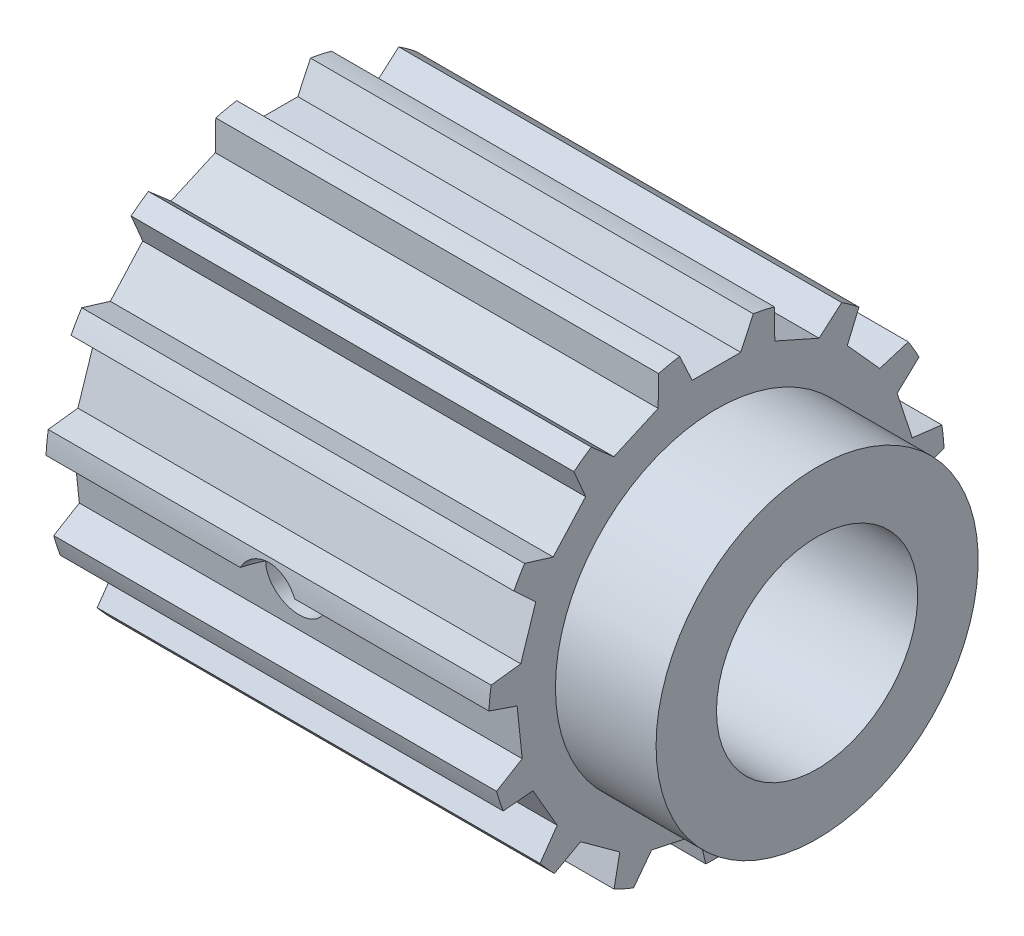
ISO-10303-21;
HEADER;
FILE_DESCRIPTION(('STEP AP214'),'2;1');
FILE_NAME('part.step','',(''),(''),'','','');
FILE_SCHEMA(('AUTOMOTIVE_DESIGN { 1 0 10303 214 1 1 1 1 }'));
ENDSEC;
DATA;
#1=APPLICATION_CONTEXT('core data for automotive mechanical design processes');
#2=APPLICATION_PROTOCOL_DEFINITION('international standard','automotive_design',2000,#1);
#3=PRODUCT_CONTEXT('',#1,'mechanical');
#4=PRODUCT('Part','Part','',(#3));
#5=PRODUCT_RELATED_PRODUCT_CATEGORY('part','',(#4));
#6=PRODUCT_DEFINITION_FORMATION('','',#4);
#7=PRODUCT_DEFINITION_CONTEXT('part definition',#1,'design');
#8=PRODUCT_DEFINITION('design','',#6,#7);
#9=PRODUCT_DEFINITION_SHAPE('','',#8);
#10=(LENGTH_UNIT() NAMED_UNIT(*) SI_UNIT(.MILLI.,.METRE.));
#11=(NAMED_UNIT(*) PLANE_ANGLE_UNIT() SI_UNIT($,.RADIAN.));
#12=(NAMED_UNIT(*) SI_UNIT($,.STERADIAN.) SOLID_ANGLE_UNIT());
#13=UNCERTAINTY_MEASURE_WITH_UNIT(LENGTH_MEASURE(1.E-05),#10,'distance_accuracy_value','');
#14=(GEOMETRIC_REPRESENTATION_CONTEXT(3) GLOBAL_UNCERTAINTY_ASSIGNED_CONTEXT((#13)) GLOBAL_UNIT_ASSIGNED_CONTEXT((#10,
#11,#12)) REPRESENTATION_CONTEXT('',''));
#15=CARTESIAN_POINT('',(0.,0.,0.));
#16=DIRECTION('',(0.,0.,1.));
#17=DIRECTION('',(1.,0.,0.));
#18=AXIS2_PLACEMENT_3D('',#15,#16,#17);
#19=CARTESIAN_POINT('',(-12.2547579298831,0.,0.));
#20=DIRECTION('',(-1.,0.,0.));
#21=DIRECTION('',(0.,0.,1.));
#22=AXIS2_PLACEMENT_3D('',#19,#20,#21);
#23=CYLINDRICAL_SURFACE('',#22,11.325);
#24=CARTESIAN_POINT('',(-5.,0.,0.));
#25=DIRECTION('',(-1.,0.,0.));
#26=DIRECTION('',(0.,0.,1.));
#27=AXIS2_PLACEMENT_3D('',#24,#25,#26);
#28=CIRCLE('',#27,11.325);
#29=CARTESIAN_POINT('',(-5.,11.1759109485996,-1.83156748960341));
#30=VERTEX_POINT('',#29);
#31=CARTESIAN_POINT('',(-5.,10.9546682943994,-2.87243234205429));
#32=VERTEX_POINT('',#31);
#33=EDGE_CURVE('E458',#30,#32,#28,.T.);
#34=ORIENTED_EDGE('',*,*,#33,.T.);
#35=DIRECTION('',(-1.,0.,0.));
#36=VECTOR('',#35,1.);
#37=CARTESIAN_POINT('',(-12.2547579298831,10.9546682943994,-2.87243234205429));
#38=LINE('',#37,#36);
#39=CARTESIAN_POINT('',(-27.,10.9546682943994,-2.87243234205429));
#40=VERTEX_POINT('',#39);
#41=EDGE_CURVE('E439',#40,#32,#38,.F.);
#42=ORIENTED_EDGE('',*,*,#41,.F.);
#43=CARTESIAN_POINT('',(-27.,0.,0.));
#44=DIRECTION('',(-1.,0.,0.));
#45=DIRECTION('',(0.,0.,1.));
#46=AXIS2_PLACEMENT_3D('',#43,#44,#45);
#47=CIRCLE('',#46,11.325);
#48=CARTESIAN_POINT('',(-27.,11.1759109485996,-1.83156748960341));
#49=VERTEX_POINT('',#48);
#50=EDGE_CURVE('E474',#49,#40,#47,.T.);
#51=ORIENTED_EDGE('',*,*,#50,.F.);
#52=DIRECTION('',(-1.,0.,0.));
#53=VECTOR('',#52,1.);
#54=CARTESIAN_POINT('',(-12.2547579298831,11.1759109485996,-1.83156748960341));
#55=LINE('',#54,#53);
#56=EDGE_CURVE('E463',#30,#49,#55,.T.);
#57=ORIENTED_EDGE('',*,*,#56,.F.);
#58=EDGE_LOOP('',(#34,#42,#51,#57));
#59=FACE_BOUND('',#58,.T.);
#60=ADVANCED_FACE('F32',(#59),#23,.T.);
#61=CARTESIAN_POINT('',(-27.,9.46473706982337,-6.21887266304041));
#62=VERTEX_POINT('',#61);
#63=CARTESIAN_POINT('',(-27.,8.83926397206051,-7.07976252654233));
#64=VERTEX_POINT('',#63);
#65=EDGE_CURVE('E481',#62,#64,#47,.T.);
#66=ORIENTED_EDGE('',*,*,#65,.F.);
#67=DIRECTION('',(-1.,0.,0.));
#68=VECTOR('',#67,1.);
#69=CARTESIAN_POINT('',(-12.2547579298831,9.46473706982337,-6.21887266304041));
#70=LINE('',#69,#68);
#71=CARTESIAN_POINT('',(-5.,9.46473706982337,-6.21887266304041));
#72=VERTEX_POINT('',#71);
#73=EDGE_CURVE('E52',#72,#62,#70,.T.);
#74=ORIENTED_EDGE('',*,*,#73,.F.);
#75=CARTESIAN_POINT('',(-5.,8.83926397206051,-7.07976252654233));
#76=VERTEX_POINT('',#75);
#77=EDGE_CURVE('E465',#72,#76,#28,.T.);
#78=ORIENTED_EDGE('',*,*,#77,.T.);
#79=DIRECTION('',(-1.,0.,0.));
#80=VECTOR('',#79,1.);
#81=CARTESIAN_POINT('',(-12.2547579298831,8.83926397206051,-7.07976252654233));
#82=LINE('',#81,#80);
#83=EDGE_CURVE('E562',#64,#76,#82,.F.);
#84=ORIENTED_EDGE('',*,*,#83,.F.);
#85=EDGE_LOOP('',(#66,#74,#78,#84));
#86=FACE_BOUND('',#85,.T.);
#87=ADVANCED_FACE('F547',(#86),#23,.T.);
#88=CARTESIAN_POINT('',(-27.,6.11702416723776,-9.53087825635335));
#89=VERTEX_POINT('',#88);
#90=CARTESIAN_POINT('',(-27.,5.19547060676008,-10.0629374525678));
#91=VERTEX_POINT('',#90);
#92=EDGE_CURVE('E485',#89,#91,#47,.T.);
#93=ORIENTED_EDGE('',*,*,#92,.F.);
#94=DIRECTION('',(-1.,0.,0.));
#95=VECTOR('',#94,1.);
#96=CARTESIAN_POINT('',(-12.2547579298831,6.11702416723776,-9.53087825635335));
#97=LINE('',#96,#95);
#98=CARTESIAN_POINT('',(-5.,6.11702416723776,-9.53087825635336));
#99=VERTEX_POINT('',#98);
#100=EDGE_CURVE('E60',#99,#89,#97,.T.);
#101=ORIENTED_EDGE('',*,*,#100,.F.);
#102=CARTESIAN_POINT('',(-5.,5.19547060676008,-10.0629374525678));
#103=VERTEX_POINT('',#102);
#104=EDGE_CURVE('E471',#99,#103,#28,.T.);
#105=ORIENTED_EDGE('',*,*,#104,.T.);
#106=DIRECTION('',(-1.,0.,0.));
#107=VECTOR('',#106,1.);
#108=CARTESIAN_POINT('',(-12.2547579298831,5.19547060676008,-10.0629374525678));
#109=LINE('',#108,#107);
#110=EDGE_CURVE('E587',#91,#103,#109,.F.);
#111=ORIENTED_EDGE('',*,*,#110,.F.);
#112=EDGE_LOOP('',(#93,#101,#105,#111));
#113=FACE_BOUND('',#112,.T.);
#114=ADVANCED_FACE('F551',(#113),#23,.T.);
#115=CARTESIAN_POINT('',(-27.,1.71162221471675,-11.1949084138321));
#116=VERTEX_POINT('',#115);
#117=CARTESIAN_POINT('',(-27.,0.653333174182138,-11.3061390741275));
#118=VERTEX_POINT('',#117);
#119=EDGE_CURVE('E1179',#116,#118,#47,.T.);
#120=ORIENTED_EDGE('',*,*,#119,.F.);
#121=DIRECTION('',(-1.,0.,0.));
#122=VECTOR('',#121,1.);
#123=CARTESIAN_POINT('',(-12.2547579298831,1.71162221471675,-11.1949084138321));
#124=LINE('',#123,#122);
#125=CARTESIAN_POINT('',(-5.,1.71162221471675,-11.1949084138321));
#126=VERTEX_POINT('',#125);
#127=EDGE_CURVE('E585',#126,#116,#124,.T.);
#128=ORIENTED_EDGE('',*,*,#127,.F.);
#129=CARTESIAN_POINT('',(-5.,0.653333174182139,-11.3061390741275));
#130=VERTEX_POINT('',#129);
#131=EDGE_CURVE('E934',#126,#130,#28,.T.);
#132=ORIENTED_EDGE('',*,*,#131,.T.);
#133=DIRECTION('',(-1.,0.,0.));
#134=VECTOR('',#133,1.);
#135=CARTESIAN_POINT('',(-12.2547579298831,0.653333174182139,-11.3061390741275));
#136=LINE('',#135,#134);
#137=CARTESIAN_POINT('',(-14.6497571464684,0.653333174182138,-11.3061390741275));
#138=VERTEX_POINT('',#137);
#139=EDGE_CURVE('E611',#138,#130,#136,.F.);
#140=ORIENTED_EDGE('',*,*,#139,.F.);
#141=CARTESIAN_POINT('',(-14.5,0.,-11.325));
#142=CARTESIAN_POINT('',(-14.5000035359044,0.0838618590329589,-11.3249987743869));
#143=CARTESIAN_POINT('',(-14.507056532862,0.167775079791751,-11.3240586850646));
#144=CARTESIAN_POINT('',(-14.535079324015,0.33326357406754,-11.320398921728));
#145=CARTESIAN_POINT('',(-14.5560633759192,0.414836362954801,-11.3176774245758));
#146=CARTESIAN_POINT('',(-14.6113166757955,0.573224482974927,-11.3107612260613));
#147=CARTESIAN_POINT('',(-14.6455766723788,0.650043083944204,-11.3065675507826));
#148=CARTESIAN_POINT('',(-14.7263884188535,0.796826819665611,-11.2971725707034));
#149=CARTESIAN_POINT('',(-14.7729381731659,0.866793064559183,-11.291971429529));
#150=CARTESIAN_POINT('',(-14.8773138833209,0.998330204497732,-11.2811057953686));
#151=CARTESIAN_POINT('',(-14.9352003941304,1.05985285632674,-11.2754389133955));
#152=CARTESIAN_POINT('',(-15.0604762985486,1.17234070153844,-11.2642995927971));
#153=CARTESIAN_POINT('',(-15.1278661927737,1.22330533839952,-11.2588271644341));
#154=CARTESIAN_POINT('',(-15.2705525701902,1.31341254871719,-11.2486729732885));
#155=CARTESIAN_POINT('',(-15.3458781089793,1.35250948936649,-11.243994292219));
#156=CARTESIAN_POINT('',(-15.5020983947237,1.41748001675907,-11.2359892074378));
#157=CARTESIAN_POINT('',(-15.5829929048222,1.44335416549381,-11.2326627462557));
#158=CARTESIAN_POINT('',(-15.7475520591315,1.48099707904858,-11.2277617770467));
#159=CARTESIAN_POINT('',(-15.8311976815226,1.49284765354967,-11.2261771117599));
#160=CARTESIAN_POINT('',(-15.9993042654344,1.50236025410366,-11.2249081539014));
#161=CARTESIAN_POINT('',(-16.0837651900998,1.50002291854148,-11.2252237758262));
#162=CARTESIAN_POINT('',(-16.2505325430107,1.48129311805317,-11.2277104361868));
#163=CARTESIAN_POINT('',(-16.3328493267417,1.46499104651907,-11.2298695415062));
#164=CARTESIAN_POINT('',(-16.4935685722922,1.4189356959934,-11.2357812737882));
#165=CARTESIAN_POINT('',(-16.5719709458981,1.38918211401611,-11.2395339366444));
#166=CARTESIAN_POINT('',(-16.7229150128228,1.31697206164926,-11.2482233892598));
#167=CARTESIAN_POINT('',(-16.7954378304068,1.27447658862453,-11.2531638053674));
#168=CARTESIAN_POINT('',(-16.932357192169,1.17801690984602,-11.2636693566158));
#169=CARTESIAN_POINT('',(-16.9967533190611,1.12405211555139,-11.2692345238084));
#170=CARTESIAN_POINT('',(-17.116115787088,1.00568602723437,-11.2804154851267));
#171=CARTESIAN_POINT('',(-17.1710049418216,0.941206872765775,-11.2860313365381));
#172=CARTESIAN_POINT('',(-17.2691934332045,0.803909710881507,-11.2966405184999));
#173=CARTESIAN_POINT('',(-17.3124927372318,0.73109167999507,-11.301633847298));
#174=CARTESIAN_POINT('',(-17.3862735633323,0.579122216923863,-11.3104390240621));
#175=CARTESIAN_POINT('',(-17.4167499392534,0.499968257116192,-11.3142503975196));
#176=CARTESIAN_POINT('',(-17.4639569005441,0.337604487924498,-11.3202580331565));
#177=CARTESIAN_POINT('',(-17.4806882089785,0.254394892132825,-11.3224543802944));
#178=CARTESIAN_POINT('',(-17.4998293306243,0.086948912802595,-11.3249733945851));
#179=CARTESIAN_POINT('',(-17.5023454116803,0.00272487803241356,-11.3253099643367));
#180=CARTESIAN_POINT('',(-17.49326555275,-0.164943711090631,-11.3241091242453));
#181=CARTESIAN_POINT('',(-17.4816699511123,-0.248388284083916,-11.3225717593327));
#182=CARTESIAN_POINT('',(-17.4447841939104,-0.411813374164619,-11.3178044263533));
#183=CARTESIAN_POINT('',(-17.4195450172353,-0.491805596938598,-11.3145807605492));
#184=CARTESIAN_POINT('',(-17.3561417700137,-0.646422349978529,-11.3068015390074));
#185=CARTESIAN_POINT('',(-17.317977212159,-0.721046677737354,-11.3022459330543));
#186=CARTESIAN_POINT('',(-17.2295516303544,-0.863281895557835,-11.2922755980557));
#187=CARTESIAN_POINT('',(-17.1792222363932,-0.930849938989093,-11.2868560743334));
#188=CARTESIAN_POINT('',(-17.0679919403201,-1.05661790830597,-11.2757783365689));
#189=CARTESIAN_POINT('',(-17.007090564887,-1.11481741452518,-11.2701201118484));
#190=CARTESIAN_POINT('',(-16.8759755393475,-1.22057598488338,-11.2591594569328));
#191=CARTESIAN_POINT('',(-16.8057046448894,-1.26806437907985,-11.2538595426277));
#192=CARTESIAN_POINT('',(-16.6581215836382,-1.35056365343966,-11.2442578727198));
#193=CARTESIAN_POINT('',(-16.5808095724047,-1.38557480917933,-11.2399560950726));
#194=CARTESIAN_POINT('',(-16.4215620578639,-1.44201270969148,-11.2328552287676));
#195=CARTESIAN_POINT('',(-16.3396406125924,-1.46347855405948,-11.2300518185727));
#196=CARTESIAN_POINT('',(-16.1733161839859,-1.492342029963,-11.2262529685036));
#197=CARTESIAN_POINT('',(-16.0889133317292,-1.4997404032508,-11.2252574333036));
#198=CARTESIAN_POINT('',(-15.9207253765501,-1.50024418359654,-11.2251900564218));
#199=CARTESIAN_POINT('',(-15.8369405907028,-1.49346063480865,-11.2261032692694));
#200=CARTESIAN_POINT('',(-15.6717135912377,-1.46602906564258,-11.2297182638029));
#201=CARTESIAN_POINT('',(-15.5902713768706,-1.4453810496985,-11.2324200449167));
#202=CARTESIAN_POINT('',(-15.4320605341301,-1.39084269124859,-11.2393029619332));
#203=CARTESIAN_POINT('',(-15.3552897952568,-1.35695838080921,-11.2434834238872));
#204=CARTESIAN_POINT('',(-15.2085056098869,-1.27692019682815,-11.2528536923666));
#205=CARTESIAN_POINT('',(-15.1384922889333,-1.23076609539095,-11.2580435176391));
#206=CARTESIAN_POINT('',(-15.006643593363,-1.12708875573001,-11.2688963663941));
#207=CARTESIAN_POINT('',(-14.9448734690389,-1.06948287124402,-11.2745626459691));
#208=CARTESIAN_POINT('',(-14.8318351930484,-0.94471067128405,-11.2857016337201));
#209=CARTESIAN_POINT('',(-14.7805695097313,-0.877542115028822,-11.2911742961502));
#210=CARTESIAN_POINT('',(-14.689806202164,-0.73521983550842,-11.3013355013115));
#211=CARTESIAN_POINT('',(-14.6503596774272,-0.660033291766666,-11.3060206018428));
#212=CARTESIAN_POINT('',(-14.5847102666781,-0.504080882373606,-11.314044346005));
#213=CARTESIAN_POINT('',(-14.5584931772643,-0.423321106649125,-11.3173844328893));
#214=CARTESIAN_POINT('',(-14.5262315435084,-0.285131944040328,-11.3215484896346));
#215=CARTESIAN_POINT('',(-14.5164090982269,-0.228569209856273,-11.3228364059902));
#216=CARTESIAN_POINT('',(-14.5032921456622,-0.114678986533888,-11.3245625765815));
#217=CARTESIAN_POINT('',(-14.4999975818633,-0.0573515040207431,-11.3250008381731));
#218=CARTESIAN_POINT('',(-14.5,0.,-11.325));
#219=B_SPLINE_CURVE_WITH_KNOTS('',3,(#141,#142,#143,#144,#145,#146,#147,#148,#149,#150,#151,
#152,#153,#154,#155,#156,#157,#158,#159,#160,#161,#162,#163,#164,#165,#166,#167,#168,#169,#170,
#171,#172,#173,#174,#175,#176,#177,#178,#179,#180,#181,#182,#183,#184,#185,#186,#187,#188,#189,
#190,#191,#192,#193,#194,#195,#196,#197,#198,#199,#200,#201,#202,#203,#204,#205,#206,#207,#208,
#209,#210,#211,#212,#213,#214,#215,#216,#217,#218),.UNSPECIFIED.,.T.,.F.,(4,2,2,2,2,2,2,2,2,2,2,
2,2,2,2,2,2,2,2,2,2,2,2,2,2,2,2,2,2,2,2,2,2,2,2,2,2,2,4),(0.,0.25137606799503,0.503009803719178,
0.754468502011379,1.00588639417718,1.25868577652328,1.51149848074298,1.76527131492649,
2.01903336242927,2.27130761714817,2.52357052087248,2.77421276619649,3.02486065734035,
3.27628374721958,3.52771974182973,3.78111009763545,4.03450116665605,4.28799383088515,
4.54147315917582,4.79305503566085,5.04463088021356,5.29527315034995,5.5459248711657,
5.79801949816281,6.05012541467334,6.30384895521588,6.5575668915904,6.81054906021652,
7.06351788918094,7.31451339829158,7.56550882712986,7.81639000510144,8.06727584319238,
8.32004271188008,8.57286890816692,8.82677291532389,9.08040374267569,9.25231646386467,
9.4242276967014),.UNSPECIFIED.);
#220=CARTESIAN_POINT('',(-17.3502428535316,0.653333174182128,-11.3061390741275));
#221=VERTEX_POINT('',#220);
#222=EDGE_CURVE('E11',#138,#221,#219,.T.);
#223=ORIENTED_EDGE('',*,*,#222,.T.);
#224=EDGE_CURVE('E614',#118,#221,#136,.F.);
#225=ORIENTED_EDGE('',*,*,#224,.F.);
#226=EDGE_LOOP('',(#120,#128,#132,#140,#223,#225));
#227=FACE_BOUND('',#226,.T.);
#228=ADVANCED_FACE('F556',(#227),#23,.T.);
#229=CARTESIAN_POINT('',(-27.,-2.98973476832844,-10.9232372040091));
#230=VERTEX_POINT('',#229);
#231=CARTESIAN_POINT('',(-27.,-4.00177149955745,-10.5944065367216));
#232=VERTEX_POINT('',#231);
#233=EDGE_CURVE('E1180',#230,#232,#47,.T.);
#234=ORIENTED_EDGE('',*,*,#233,.F.);
#235=DIRECTION('',(-1.,0.,0.));
#236=VECTOR('',#235,1.);
#237=CARTESIAN_POINT('',(-12.2547579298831,-2.98973476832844,-10.9232372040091));
#238=LINE('',#237,#236);
#239=CARTESIAN_POINT('',(-5.,-2.98973476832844,-10.9232372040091));
#240=VERTEX_POINT('',#239);
#241=EDGE_CURVE('E609',#240,#230,#238,.T.);
#242=ORIENTED_EDGE('',*,*,#241,.F.);
#243=CARTESIAN_POINT('',(-5.,-4.00177149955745,-10.5944065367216));
#244=VERTEX_POINT('',#243);
#245=EDGE_CURVE('E1157',#240,#244,#28,.T.);
#246=ORIENTED_EDGE('',*,*,#245,.T.);
#247=DIRECTION('',(-1.,0.,0.));
#248=VECTOR('',#247,1.);
#249=CARTESIAN_POINT('',(-12.2547579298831,-4.00177149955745,-10.5944065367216));
#250=LINE('',#249,#248);
#251=EDGE_CURVE('E643',#232,#244,#250,.F.);
#252=ORIENTED_EDGE('',*,*,#251,.F.);
#253=EDGE_LOOP('',(#234,#242,#246,#252));
#254=FACE_BOUND('',#253,.T.);
#255=ADVANCED_FACE('F1272',(#254),#23,.T.);
#256=CARTESIAN_POINT('',(-27.,-7.17413944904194,-8.76283904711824));
#257=VERTEX_POINT('',#256);
#258=CARTESIAN_POINT('',(-27.,-7.9649335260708,-8.05080486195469));
#259=VERTEX_POINT('',#258);
#260=EDGE_CURVE('E1181',#257,#259,#47,.T.);
#261=ORIENTED_EDGE('',*,*,#260,.F.);
#262=DIRECTION('',(-1.,0.,0.));
#263=VECTOR('',#262,1.);
#264=CARTESIAN_POINT('',(-12.2547579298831,-7.17413944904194,-8.76283904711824));
#265=LINE('',#264,#263);
#266=CARTESIAN_POINT('',(-5.,-7.17413944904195,-8.76283904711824));
#267=VERTEX_POINT('',#266);
#268=EDGE_CURVE('E641',#267,#257,#265,.T.);
#269=ORIENTED_EDGE('',*,*,#268,.F.);
#270=CARTESIAN_POINT('',(-5.,-7.9649335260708,-8.05080486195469));
#271=VERTEX_POINT('',#270);
#272=EDGE_CURVE('E1152',#267,#271,#28,.T.);
#273=ORIENTED_EDGE('',*,*,#272,.T.);
#274=DIRECTION('',(-1.,0.,0.));
#275=VECTOR('',#274,1.);
#276=CARTESIAN_POINT('',(-12.2547579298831,-7.9649335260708,-8.05080486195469));
#277=LINE('',#276,#275);
#278=EDGE_CURVE('E667',#259,#271,#277,.F.);
#279=ORIENTED_EDGE('',*,*,#278,.F.);
#280=EDGE_LOOP('',(#261,#269,#273,#279));
#281=FACE_BOUND('',#280,.T.);
#282=ADVANCED_FACE('F1266',(#281),#23,.T.);
#283=CARTESIAN_POINT('',(-27.,-10.1180702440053,-5.08726641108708));
#284=VERTEX_POINT('',#283);
#285=CARTESIAN_POINT('',(-27.,-10.550886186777,-4.11514588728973));
#286=VERTEX_POINT('',#285);
#287=EDGE_CURVE('E1183',#284,#286,#47,.T.);
#288=ORIENTED_EDGE('',*,*,#287,.F.);
#289=DIRECTION('',(-1.,0.,0.));
#290=VECTOR('',#289,1.);
#291=CARTESIAN_POINT('',(-12.2547579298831,-10.1180702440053,-5.08726641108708));
#292=LINE('',#291,#290);
#293=CARTESIAN_POINT('',(-5.,-10.1180702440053,-5.08726641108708));
#294=VERTEX_POINT('',#293);
#295=EDGE_CURVE('E665',#294,#284,#292,.T.);
#296=ORIENTED_EDGE('',*,*,#295,.F.);
#297=CARTESIAN_POINT('',(-5.,-10.550886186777,-4.11514588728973));
#298=VERTEX_POINT('',#297);
#299=EDGE_CURVE('E1147',#294,#298,#28,.T.);
#300=ORIENTED_EDGE('',*,*,#299,.T.);
#301=DIRECTION('',(-1.,0.,0.));
#302=VECTOR('',#301,1.);
#303=CARTESIAN_POINT('',(-12.2547579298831,-10.550886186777,-4.11514588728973));
#304=LINE('',#303,#302);
#305=EDGE_CURVE('E691',#286,#298,#304,.F.);
#306=ORIENTED_EDGE('',*,*,#305,.F.);
#307=EDGE_LOOP('',(#288,#296,#300,#306));
#308=FACE_BOUND('',#307,.T.);
#309=ADVANCED_FACE('F1259',(#308),#23,.T.);
#310=CARTESIAN_POINT('',(-27.,-11.3124947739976,-0.532059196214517));
#311=VERTEX_POINT('',#310);
#312=CARTESIAN_POINT('',(-27.,-11.3124947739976,0.532059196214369));
#313=VERTEX_POINT('',#312);
#314=EDGE_CURVE('E1187',#311,#313,#47,.T.);
#315=ORIENTED_EDGE('',*,*,#314,.F.);
#316=DIRECTION('',(-1.,0.,0.));
#317=VECTOR('',#316,1.);
#318=CARTESIAN_POINT('',(-12.2547579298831,-11.3124947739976,-0.532059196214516));
#319=LINE('',#318,#317);
#320=CARTESIAN_POINT('',(-5.,-11.3124947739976,-0.532059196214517));
#321=VERTEX_POINT('',#320);
#322=EDGE_CURVE('E689',#321,#311,#319,.T.);
#323=ORIENTED_EDGE('',*,*,#322,.F.);
#324=CARTESIAN_POINT('',(-5.,-11.3124947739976,0.53205919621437));
#325=VERTEX_POINT('',#324);
#326=EDGE_CURVE('E1142',#321,#325,#28,.T.);
#327=ORIENTED_EDGE('',*,*,#326,.T.);
#328=DIRECTION('',(-1.,0.,0.));
#329=VECTOR('',#328,1.);
#330=CARTESIAN_POINT('',(-12.2547579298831,-11.3124947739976,0.532059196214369));
#331=LINE('',#330,#329);
#332=EDGE_CURVE('E715',#313,#325,#331,.F.);
#333=ORIENTED_EDGE('',*,*,#332,.F.);
#334=EDGE_LOOP('',(#315,#323,#327,#333));
#335=FACE_BOUND('',#334,.T.);
#336=ADVANCED_FACE('F1252',(#335),#23,.T.);
#337=CARTESIAN_POINT('',(-27.,-10.5508861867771,4.11514588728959));
#338=VERTEX_POINT('',#337);
#339=CARTESIAN_POINT('',(-27.,-10.1180702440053,5.08726641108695));
#340=VERTEX_POINT('',#339);
#341=EDGE_CURVE('E1191',#338,#340,#47,.T.);
#342=ORIENTED_EDGE('',*,*,#341,.F.);
#343=DIRECTION('',(-1.,0.,0.));
#344=VECTOR('',#343,1.);
#345=CARTESIAN_POINT('',(-12.2547579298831,-10.5508861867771,4.11514588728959));
#346=LINE('',#345,#344);
#347=CARTESIAN_POINT('',(-5.,-10.5508861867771,4.11514588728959));
#348=VERTEX_POINT('',#347);
#349=EDGE_CURVE('E713',#348,#338,#346,.T.);
#350=ORIENTED_EDGE('',*,*,#349,.F.);
#351=CARTESIAN_POINT('',(-5.,-10.1180702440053,5.08726641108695));
#352=VERTEX_POINT('',#351);
#353=EDGE_CURVE('E1137',#348,#352,#28,.T.);
#354=ORIENTED_EDGE('',*,*,#353,.T.);
#355=DIRECTION('',(-1.,0.,0.));
#356=VECTOR('',#355,1.);
#357=CARTESIAN_POINT('',(-12.2547579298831,-10.1180702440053,5.08726641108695));
#358=LINE('',#357,#356);
#359=EDGE_CURVE('E739',#340,#352,#358,.F.);
#360=ORIENTED_EDGE('',*,*,#359,.F.);
#361=EDGE_LOOP('',(#342,#350,#354,#360));
#362=FACE_BOUND('',#361,.T.);
#363=ADVANCED_FACE('F1245',(#362),#23,.T.);
#364=CARTESIAN_POINT('',(-27.,-7.96493352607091,8.05080486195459));
#365=VERTEX_POINT('',#364);
#366=CARTESIAN_POINT('',(-27.,-7.17413944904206,8.76283904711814));
#367=VERTEX_POINT('',#366);
#368=EDGE_CURVE('E1195',#365,#367,#47,.T.);
#369=ORIENTED_EDGE('',*,*,#368,.F.);
#370=DIRECTION('',(-1.,0.,0.));
#371=VECTOR('',#370,1.);
#372=CARTESIAN_POINT('',(-12.2547579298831,-7.96493352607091,8.05080486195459));
#373=LINE('',#372,#371);
#374=CARTESIAN_POINT('',(-5.,-7.96493352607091,8.05080486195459));
#375=VERTEX_POINT('',#374);
#376=EDGE_CURVE('E737',#375,#365,#373,.T.);
#377=ORIENTED_EDGE('',*,*,#376,.F.);
#378=CARTESIAN_POINT('',(-5.,-7.17413944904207,8.76283904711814));
#379=VERTEX_POINT('',#378);
#380=EDGE_CURVE('E1132',#375,#379,#28,.T.);
#381=ORIENTED_EDGE('',*,*,#380,.T.);
#382=DIRECTION('',(-1.,0.,0.));
#383=VECTOR('',#382,1.);
#384=CARTESIAN_POINT('',(-12.2547579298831,-7.17413944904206,8.76283904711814));
#385=LINE('',#384,#383);
#386=EDGE_CURVE('E763',#367,#379,#385,.F.);
#387=ORIENTED_EDGE('',*,*,#386,.F.);
#388=EDGE_LOOP('',(#369,#377,#381,#387));
#389=FACE_BOUND('',#388,.T.);
#390=ADVANCED_FACE('F1238',(#389),#23,.T.);
#391=CARTESIAN_POINT('',(-27.,-4.0017714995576,10.5944065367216));
#392=VERTEX_POINT('',#391);
#393=CARTESIAN_POINT('',(-27.,-2.98973476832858,10.923237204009));
#394=VERTEX_POINT('',#393);
#395=EDGE_CURVE('E1199',#392,#394,#47,.T.);
#396=ORIENTED_EDGE('',*,*,#395,.F.);
#397=DIRECTION('',(-1.,0.,0.));
#398=VECTOR('',#397,1.);
#399=CARTESIAN_POINT('',(-12.2547579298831,-4.0017714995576,10.5944065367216));
#400=LINE('',#399,#398);
#401=CARTESIAN_POINT('',(-5.,-4.0017714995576,10.5944065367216));
#402=VERTEX_POINT('',#401);
#403=EDGE_CURVE('E761',#402,#392,#400,.T.);
#404=ORIENTED_EDGE('',*,*,#403,.F.);
#405=CARTESIAN_POINT('',(-5.,-2.98973476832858,10.923237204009));
#406=VERTEX_POINT('',#405);
#407=EDGE_CURVE('E1127',#402,#406,#28,.T.);
#408=ORIENTED_EDGE('',*,*,#407,.T.);
#409=DIRECTION('',(-1.,0.,0.));
#410=VECTOR('',#409,1.);
#411=CARTESIAN_POINT('',(-12.2547579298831,-2.98973476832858,10.923237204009));
#412=LINE('',#411,#410);
#413=EDGE_CURVE('E788',#394,#406,#412,.F.);
#414=ORIENTED_EDGE('',*,*,#413,.F.);
#415=EDGE_LOOP('',(#396,#404,#408,#414));
#416=FACE_BOUND('',#415,.T.);
#417=ADVANCED_FACE('F1231',(#416),#23,.T.);
#418=CARTESIAN_POINT('',(-14.5,0.,11.325));
#419=CARTESIAN_POINT('',(-14.5000035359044,-0.0838618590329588,11.3249987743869));
#420=CARTESIAN_POINT('',(-14.507056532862,-0.167775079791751,11.3240586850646));
#421=CARTESIAN_POINT('',(-14.535079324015,-0.33326357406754,11.320398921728));
#422=CARTESIAN_POINT('',(-14.5560633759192,-0.414836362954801,11.3176774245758));
#423=CARTESIAN_POINT('',(-14.6113166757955,-0.573224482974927,11.3107612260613));
#424=CARTESIAN_POINT('',(-14.6455766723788,-0.650043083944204,11.3065675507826));
#425=CARTESIAN_POINT('',(-14.7263884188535,-0.796826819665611,11.2971725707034));
#426=CARTESIAN_POINT('',(-14.7729381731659,-0.866793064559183,11.291971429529));
#427=CARTESIAN_POINT('',(-14.8773138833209,-0.998330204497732,11.2811057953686));
#428=CARTESIAN_POINT('',(-14.9352003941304,-1.05985285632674,11.2754389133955));
#429=CARTESIAN_POINT('',(-15.0604762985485,-1.17234070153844,11.2642995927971));
#430=CARTESIAN_POINT('',(-15.1278661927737,-1.22330533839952,11.2588271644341));
#431=CARTESIAN_POINT('',(-15.2705525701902,-1.31341254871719,11.2486729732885));
#432=CARTESIAN_POINT('',(-15.3458781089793,-1.35250948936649,11.243994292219));
#433=CARTESIAN_POINT('',(-15.5020983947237,-1.41748001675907,11.2359892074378));
#434=CARTESIAN_POINT('',(-15.5829929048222,-1.44335416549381,11.2326627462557));
#435=CARTESIAN_POINT('',(-15.7475520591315,-1.48099707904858,11.2277617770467));
#436=CARTESIAN_POINT('',(-15.8311976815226,-1.49284765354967,11.2261771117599));
#437=CARTESIAN_POINT('',(-15.9993042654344,-1.50236025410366,11.2249081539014));
#438=CARTESIAN_POINT('',(-16.0837651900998,-1.50002291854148,11.2252237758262));
#439=CARTESIAN_POINT('',(-16.2505325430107,-1.48129311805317,11.2277104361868));
#440=CARTESIAN_POINT('',(-16.3328493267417,-1.46499104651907,11.2298695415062));
#441=CARTESIAN_POINT('',(-16.4935685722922,-1.4189356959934,11.2357812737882));
#442=CARTESIAN_POINT('',(-16.5719709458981,-1.38918211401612,11.2395339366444));
#443=CARTESIAN_POINT('',(-16.7229150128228,-1.31697206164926,11.2482233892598));
#444=CARTESIAN_POINT('',(-16.7954378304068,-1.27447658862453,11.2531638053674));
#445=CARTESIAN_POINT('',(-16.932357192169,-1.17801690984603,11.2636693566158));
#446=CARTESIAN_POINT('',(-16.9967533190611,-1.12405211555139,11.2692345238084));
#447=CARTESIAN_POINT('',(-17.116115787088,-1.00568602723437,11.2804154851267));
#448=CARTESIAN_POINT('',(-17.1710049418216,-0.941206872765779,11.2860313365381));
#449=CARTESIAN_POINT('',(-17.2691934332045,-0.803909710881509,11.2966405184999));
#450=CARTESIAN_POINT('',(-17.3124927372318,-0.731091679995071,11.301633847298));
#451=CARTESIAN_POINT('',(-17.3862735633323,-0.579122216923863,11.3104390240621));
#452=CARTESIAN_POINT('',(-17.4167499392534,-0.499968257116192,11.3142503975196));
#453=CARTESIAN_POINT('',(-17.4639569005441,-0.337604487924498,11.3202580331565));
#454=CARTESIAN_POINT('',(-17.4806882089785,-0.254394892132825,11.3224543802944));
#455=CARTESIAN_POINT('',(-17.4998293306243,-0.0869489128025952,11.3249733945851));
#456=CARTESIAN_POINT('',(-17.5023454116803,-0.00272487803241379,11.3253099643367));
#457=CARTESIAN_POINT('',(-17.49326555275,0.16494371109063,11.3241091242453));
#458=CARTESIAN_POINT('',(-17.4816699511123,0.248388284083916,11.3225717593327));
#459=CARTESIAN_POINT('',(-17.4447841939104,0.411813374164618,11.3178044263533));
#460=CARTESIAN_POINT('',(-17.4195450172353,0.491805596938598,11.3145807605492));
#461=CARTESIAN_POINT('',(-17.3561417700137,0.646422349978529,11.3068015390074));
#462=CARTESIAN_POINT('',(-17.317977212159,0.721046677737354,11.3022459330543));
#463=CARTESIAN_POINT('',(-17.2295516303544,0.863281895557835,11.2922755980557));
#464=CARTESIAN_POINT('',(-17.1792222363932,0.930849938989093,11.2868560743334));
#465=CARTESIAN_POINT('',(-17.0679919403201,1.05661790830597,11.2757783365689));
#466=CARTESIAN_POINT('',(-17.007090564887,1.11481741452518,11.2701201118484));
#467=CARTESIAN_POINT('',(-16.8759755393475,1.22057598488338,11.2591594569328));
#468=CARTESIAN_POINT('',(-16.8057046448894,1.26806437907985,11.2538595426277));
#469=CARTESIAN_POINT('',(-16.6581215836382,1.35056365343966,11.2442578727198));
#470=CARTESIAN_POINT('',(-16.5808095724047,1.38557480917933,11.2399560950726));
#471=CARTESIAN_POINT('',(-16.4215620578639,1.44201270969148,11.2328552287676));
#472=CARTESIAN_POINT('',(-16.3396406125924,1.46347855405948,11.2300518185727));
#473=CARTESIAN_POINT('',(-16.1733161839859,1.492342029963,11.2262529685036));
#474=CARTESIAN_POINT('',(-16.0889133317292,1.4997404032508,11.2252574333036));
#475=CARTESIAN_POINT('',(-15.9207253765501,1.50024418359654,11.2251900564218));
#476=CARTESIAN_POINT('',(-15.8369405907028,1.49346063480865,11.2261032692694));
#477=CARTESIAN_POINT('',(-15.6717135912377,1.46602906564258,11.2297182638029));
#478=CARTESIAN_POINT('',(-15.5902713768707,1.4453810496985,11.2324200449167));
#479=CARTESIAN_POINT('',(-15.4320605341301,1.39084269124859,11.2393029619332));
#480=CARTESIAN_POINT('',(-15.3552897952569,1.35695838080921,11.2434834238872));
#481=CARTESIAN_POINT('',(-15.2085056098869,1.27692019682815,11.2528536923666));
#482=CARTESIAN_POINT('',(-15.1384922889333,1.23076609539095,11.2580435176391));
#483=CARTESIAN_POINT('',(-15.006643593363,1.12708875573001,11.2688963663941));
#484=CARTESIAN_POINT('',(-14.9448734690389,1.06948287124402,11.2745626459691));
#485=CARTESIAN_POINT('',(-14.8318351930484,0.94471067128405,11.2857016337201));
#486=CARTESIAN_POINT('',(-14.7805695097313,0.877542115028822,11.2911742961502));
#487=CARTESIAN_POINT('',(-14.689806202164,0.73521983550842,11.3013355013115));
#488=CARTESIAN_POINT('',(-14.6503596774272,0.660033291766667,11.3060206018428));
#489=CARTESIAN_POINT('',(-14.5847102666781,0.504080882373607,11.314044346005));
#490=CARTESIAN_POINT('',(-14.5584931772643,0.423321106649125,11.3173844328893));
#491=CARTESIAN_POINT('',(-14.5262315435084,0.285131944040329,11.3215484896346));
#492=CARTESIAN_POINT('',(-14.5164090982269,0.228569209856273,11.3228364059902));
#493=CARTESIAN_POINT('',(-14.5032921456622,0.114678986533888,11.3245625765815));
#494=CARTESIAN_POINT('',(-14.4999975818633,0.0573515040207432,11.3250008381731));
#495=CARTESIAN_POINT('',(-14.5,0.,11.325));
#496=B_SPLINE_CURVE_WITH_KNOTS('',3,(#418,#419,#420,#421,#422,#423,#424,#425,#426,#427,#428,
#429,#430,#431,#432,#433,#434,#435,#436,#437,#438,#439,#440,#441,#442,#443,#444,#445,#446,#447,
#448,#449,#450,#451,#452,#453,#454,#455,#456,#457,#458,#459,#460,#461,#462,#463,#464,#465,#466,
#467,#468,#469,#470,#471,#472,#473,#474,#475,#476,#477,#478,#479,#480,#481,#482,#483,#484,#485,
#486,#487,#488,#489,#490,#491,#492,#493,#494,#495),.UNSPECIFIED.,.T.,.F.,(4,2,2,2,2,2,2,2,2,2,2,
2,2,2,2,2,2,2,2,2,2,2,2,2,2,2,2,2,2,2,2,2,2,2,2,2,2,2,4),(0.,0.25137606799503,0.503009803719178,
0.754468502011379,1.00588639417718,1.25868577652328,1.51149848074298,1.76527131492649,
2.01903336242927,2.27130761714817,2.52357052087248,2.77421276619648,3.02486065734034,
3.27628374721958,3.52771974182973,3.78111009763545,4.03450116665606,4.28799383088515,
4.54147315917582,4.79305503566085,5.04463088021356,5.29527315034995,5.5459248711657,
5.79801949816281,6.05012541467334,6.30384895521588,6.5575668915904,6.81054906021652,
7.06351788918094,7.31451339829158,7.56550882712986,7.81639000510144,8.06727584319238,
8.32004271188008,8.57286890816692,8.82677291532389,9.08040374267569,9.25231646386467,
9.4242276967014),.UNSPECIFIED.);
#497=CARTESIAN_POINT('',(-17.3502428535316,0.653333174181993,11.3061390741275));
#498=VERTEX_POINT('',#497);
#499=CARTESIAN_POINT('',(-14.6497571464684,0.653333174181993,11.3061390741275));
#500=VERTEX_POINT('',#499);
#501=EDGE_CURVE('E45',#498,#500,#496,.T.);
#502=ORIENTED_EDGE('',*,*,#501,.T.);
#503=DIRECTION('',(-1.,0.,0.));
#504=VECTOR('',#503,1.);
#505=CARTESIAN_POINT('',(-12.2547579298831,0.653333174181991,11.3061390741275));
#506=LINE('',#505,#504);
#507=CARTESIAN_POINT('',(-5.,0.653333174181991,11.3061390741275));
#508=VERTEX_POINT('',#507);
#509=EDGE_CURVE('E787',#508,#500,#506,.T.);
#510=ORIENTED_EDGE('',*,*,#509,.F.);
#511=CARTESIAN_POINT('',(-5.,1.71162221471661,11.1949084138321));
#512=VERTEX_POINT('',#511);
#513=EDGE_CURVE('E1126',#508,#512,#28,.T.);
#514=ORIENTED_EDGE('',*,*,#513,.T.);
#515=DIRECTION('',(-1.,0.,0.));
#516=VECTOR('',#515,1.);
#517=CARTESIAN_POINT('',(-12.2547579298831,1.71162221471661,11.1949084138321));
#518=LINE('',#517,#516);
#519=CARTESIAN_POINT('',(-27.,1.71162221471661,11.1949084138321));
#520=VERTEX_POINT('',#519);
#521=EDGE_CURVE('E819',#520,#512,#518,.F.);
#522=ORIENTED_EDGE('',*,*,#521,.F.);
#523=CARTESIAN_POINT('',(-27.,0.653333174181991,11.3061390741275));
#524=VERTEX_POINT('',#523);
#525=EDGE_CURVE('E1203',#524,#520,#47,.T.);
#526=ORIENTED_EDGE('',*,*,#525,.F.);
#527=EDGE_CURVE('E785',#498,#524,#506,.T.);
#528=ORIENTED_EDGE('',*,*,#527,.F.);
#529=EDGE_LOOP('',(#502,#510,#514,#522,#526,#528));
#530=FACE_BOUND('',#529,.T.);
#531=ADVANCED_FACE('F1216',(#530),#23,.T.);
#532=CARTESIAN_POINT('',(-27.,5.19547060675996,10.0629374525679));
#533=VERTEX_POINT('',#532);
#534=CARTESIAN_POINT('',(-27.,6.11702416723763,9.53087825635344));
#535=VERTEX_POINT('',#534);
#536=EDGE_CURVE('E493',#533,#535,#47,.T.);
#537=ORIENTED_EDGE('',*,*,#536,.F.);
#538=DIRECTION('',(-1.,0.,0.));
#539=VECTOR('',#538,1.);
#540=CARTESIAN_POINT('',(-12.2547579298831,5.19547060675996,10.0629374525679));
#541=LINE('',#540,#539);
#542=CARTESIAN_POINT('',(-5.,5.19547060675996,10.0629374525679));
#543=VERTEX_POINT('',#542);
#544=EDGE_CURVE('E817',#543,#533,#541,.T.);
#545=ORIENTED_EDGE('',*,*,#544,.F.);
#546=CARTESIAN_POINT('',(-5.,6.11702416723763,9.53087825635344));
#547=VERTEX_POINT('',#546);
#548=EDGE_CURVE('E480',#543,#547,#28,.T.);
#549=ORIENTED_EDGE('',*,*,#548,.T.);
#550=DIRECTION('',(-1.,0.,0.));
#551=VECTOR('',#550,1.);
#552=CARTESIAN_POINT('',(-12.2547579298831,6.11702416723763,9.53087825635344));
#553=LINE('',#552,#551);
#554=EDGE_CURVE('E843',#535,#547,#553,.F.);
#555=ORIENTED_EDGE('',*,*,#554,.F.);
#556=EDGE_LOOP('',(#537,#545,#549,#555));
#557=FACE_BOUND('',#556,.T.);
#558=ADVANCED_FACE('F1124',(#557),#23,.T.);
#559=CARTESIAN_POINT('',(-27.,8.83926397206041,7.07976252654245));
#560=VERTEX_POINT('',#559);
#561=CARTESIAN_POINT('',(-27.,9.46473706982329,6.21887266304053));
#562=VERTEX_POINT('',#561);
#563=EDGE_CURVE('E487',#560,#562,#47,.T.);
#564=ORIENTED_EDGE('',*,*,#563,.F.);
#565=DIRECTION('',(-1.,0.,0.));
#566=VECTOR('',#565,1.);
#567=CARTESIAN_POINT('',(-12.2547579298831,8.83926397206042,7.07976252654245));
#568=LINE('',#567,#566);
#569=CARTESIAN_POINT('',(-5.,8.83926397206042,7.07976252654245));
#570=VERTEX_POINT('',#569);
#571=EDGE_CURVE('E841',#570,#560,#568,.T.);
#572=ORIENTED_EDGE('',*,*,#571,.F.);
#573=CARTESIAN_POINT('',(-5.,9.46473706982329,6.21887266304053));
#574=VERTEX_POINT('',#573);
#575=EDGE_CURVE('E473',#570,#574,#28,.T.);
#576=ORIENTED_EDGE('',*,*,#575,.T.);
#577=DIRECTION('',(-1.,0.,0.));
#578=VECTOR('',#577,1.);
#579=CARTESIAN_POINT('',(-12.2547579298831,9.46473706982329,6.21887266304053));
#580=LINE('',#579,#578);
#581=EDGE_CURVE('E867',#562,#574,#580,.F.);
#582=ORIENTED_EDGE('',*,*,#581,.F.);
#583=EDGE_LOOP('',(#564,#572,#576,#582));
#584=FACE_BOUND('',#583,.T.);
#585=ADVANCED_FACE('F530',(#584),#23,.T.);
#586=CARTESIAN_POINT('',(-12.2547579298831,0.,0.));
#587=DIRECTION('',(-1.,0.,0.));
#588=DIRECTION('',(0.,0.,1.));
#589=AXIS2_PLACEMENT_3D('',#586,#587,#588);
#590=CYLINDRICAL_SURFACE('',#589,5.);
#591=CARTESIAN_POINT('',(-14.5,0.,5.));
#592=CARTESIAN_POINT('',(-14.5000009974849,0.0822886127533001,4.9999992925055));
#593=CARTESIAN_POINT('',(-14.506793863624,0.16458731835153,4.99794915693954));
#594=CARTESIAN_POINT('',(-14.5337213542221,0.326788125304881,4.98997105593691));
#595=CARTESIAN_POINT('',(-14.5538599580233,0.40668950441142,4.98404193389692));
#596=CARTESIAN_POINT('',(-14.6067460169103,0.561732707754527,4.96895552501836));
#597=CARTESIAN_POINT('',(-14.6394748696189,0.636881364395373,4.95980300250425));
#598=CARTESIAN_POINT('',(-14.7165360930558,0.780624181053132,4.93922109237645));
#599=CARTESIAN_POINT('',(-14.7608700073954,0.84921746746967,4.92779140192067));
#600=CARTESIAN_POINT('',(-14.8612240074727,0.979871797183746,4.90350737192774));
#601=CARTESIAN_POINT('',(-14.9175166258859,1.04171807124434,4.89062383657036));
#602=CARTESIAN_POINT('',(-15.0396092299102,1.15524920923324,4.86505834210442));
#603=CARTESIAN_POINT('',(-15.105410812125,1.20693236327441,4.85237641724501));
#604=CARTESIAN_POINT('',(-15.2464707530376,1.29980037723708,4.82834113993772));
#605=CARTESIAN_POINT('',(-15.3219084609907,1.34072309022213,4.81702406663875));
#606=CARTESIAN_POINT('',(-15.4789892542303,1.4092139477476,4.79743620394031));
#607=CARTESIAN_POINT('',(-15.560630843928,1.43678529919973,4.78916468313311));
#608=CARTESIAN_POINT('',(-15.7253902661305,1.47701633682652,4.77690870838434));
#609=CARTESIAN_POINT('',(-15.8084027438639,1.49007196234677,4.77281069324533));
#610=CARTESIAN_POINT('',(-15.9755331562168,1.50213730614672,4.76902789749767));
#611=CARTESIAN_POINT('',(-16.0596508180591,1.50115042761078,4.76934204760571));
#612=CARTESIAN_POINT('',(-16.2233839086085,1.48546977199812,4.77424744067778));
#613=CARTESIAN_POINT('',(-16.3030522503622,1.47127205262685,4.7786838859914));
#614=CARTESIAN_POINT('',(-16.4588197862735,1.43037420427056,4.79108356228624));
#615=CARTESIAN_POINT('',(-16.5349186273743,1.40367284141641,4.79904714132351));
#616=CARTESIAN_POINT('',(-16.6826003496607,1.33816026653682,4.81772733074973));
#617=CARTESIAN_POINT('',(-16.7541070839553,1.29918816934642,4.82848016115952));
#618=CARTESIAN_POINT('',(-16.8897320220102,1.21035222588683,4.85150987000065));
#619=CARTESIAN_POINT('',(-16.9538484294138,1.16048574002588,4.86378711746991));
#620=CARTESIAN_POINT('',(-17.075686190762,1.04881290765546,4.88911011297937));
#621=CARTESIAN_POINT('',(-17.1330286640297,0.986594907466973,4.90216654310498));
#622=CARTESIAN_POINT('',(-17.2365539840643,0.853263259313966,4.92712244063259));
#623=CARTESIAN_POINT('',(-17.2827361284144,0.782149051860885,4.9390218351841));
#624=CARTESIAN_POINT('',(-17.3628599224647,0.6323550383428,4.9604316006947));
#625=CARTESIAN_POINT('',(-17.3967175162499,0.553627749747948,4.96992543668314));
#626=CARTESIAN_POINT('',(-17.4505995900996,0.391245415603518,4.98533521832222));
#627=CARTESIAN_POINT('',(-17.4706279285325,0.30759175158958,4.99125216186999));
#628=CARTESIAN_POINT('',(-17.4956521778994,0.140952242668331,4.99868364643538));
#629=CARTESIAN_POINT('',(-17.5011615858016,0.0580500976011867,5.0003485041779));
#630=CARTESIAN_POINT('',(-17.4984308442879,-0.107499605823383,4.9995292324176));
#631=CARTESIAN_POINT('',(-17.4901925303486,-0.190147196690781,4.99704565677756));
#632=CARTESIAN_POINT('',(-17.4606153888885,-0.350903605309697,4.98830696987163));
#633=CARTESIAN_POINT('',(-17.4395766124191,-0.429072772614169,4.98213829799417));
#634=CARTESIAN_POINT('',(-17.3853567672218,-0.580754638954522,4.96674347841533));
#635=CARTESIAN_POINT('',(-17.3521742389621,-0.654266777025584,4.95751696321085));
#636=CARTESIAN_POINT('',(-17.2737468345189,-0.796437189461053,4.93669654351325));
#637=CARTESIAN_POINT('',(-17.228240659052,-0.86494382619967,4.92505280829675));
#638=CARTESIAN_POINT('',(-17.1267752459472,-0.993523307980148,4.90073468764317));
#639=CARTESIAN_POINT('',(-17.0708133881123,-1.05359403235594,4.8880600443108));
#640=CARTESIAN_POINT('',(-16.9476126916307,-1.16585744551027,4.86253171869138));
#641=CARTESIAN_POINT('',(-16.8800381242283,-1.21768481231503,4.84968825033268));
#642=CARTESIAN_POINT('',(-16.7368720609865,-1.30928995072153,4.82576515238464));
#643=CARTESIAN_POINT('',(-16.6612807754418,-1.34906803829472,4.81468547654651));
#644=CARTESIAN_POINT('',(-16.5044675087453,-1.41517347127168,4.79567189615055));
#645=CARTESIAN_POINT('',(-16.4232738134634,-1.4415634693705,4.78772337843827));
#646=CARTESIAN_POINT('',(-16.2573120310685,-1.48021730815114,4.77591594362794));
#647=CARTESIAN_POINT('',(-16.1725451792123,-1.49248598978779,4.772055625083));
#648=CARTESIAN_POINT('',(-16.0056384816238,-1.50221984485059,4.76899972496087));
#649=CARTESIAN_POINT('',(-15.9235363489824,-1.5002805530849,4.76961647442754));
#650=CARTESIAN_POINT('',(-15.7608858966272,-1.48307505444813,4.77499401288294));
#651=CARTESIAN_POINT('',(-15.6803375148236,-1.46780938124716,4.77975463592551));
#652=CARTESIAN_POINT('',(-15.5240546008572,-1.42476888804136,4.79275763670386));
#653=CARTESIAN_POINT('',(-15.4482727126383,-1.39715175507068,4.80095604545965));
#654=CARTESIAN_POINT('',(-15.3023575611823,-1.33031507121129,4.81990278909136));
#655=CARTESIAN_POINT('',(-15.2322253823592,-1.29109329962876,4.83065161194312));
#656=CARTESIAN_POINT('',(-15.0968368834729,-1.20048763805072,4.85397676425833));
#657=CARTESIAN_POINT('',(-15.0318512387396,-1.14871276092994,4.86660540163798));
#658=CARTESIAN_POINT('',(-14.9112975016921,-1.03517434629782,4.89201320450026));
#659=CARTESIAN_POINT('',(-14.8557318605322,-0.973408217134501,4.90479240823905));
#660=CARTESIAN_POINT('',(-14.753976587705,-0.839465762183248,4.92950936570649));
#661=CARTESIAN_POINT('',(-14.7081085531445,-0.767037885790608,4.94141159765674));
#662=CARTESIAN_POINT('',(-14.629264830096,-0.615141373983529,4.96260680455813));
#663=CARTESIAN_POINT('',(-14.5962831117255,-0.535676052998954,4.97190099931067));
#664=CARTESIAN_POINT('',(-14.5471047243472,-0.380757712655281,4.98602174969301));
#665=CARTESIAN_POINT('',(-14.5294883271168,-0.305786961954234,4.99122027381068));
#666=CARTESIAN_POINT('',(-14.5059364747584,-0.15388019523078,4.99820944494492));
#667=CARTESIAN_POINT('',(-14.4999990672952,-0.0769445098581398,5.0000006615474));
#668=CARTESIAN_POINT('',(-14.5,0.,5.));
#669=B_SPLINE_CURVE_WITH_KNOTS('',3,(#591,#592,#593,#594,#595,#596,#597,#598,#599,#600,#601,
#602,#603,#604,#605,#606,#607,#608,#609,#610,#611,#612,#613,#614,#615,#616,#617,#618,#619,#620,
#621,#622,#623,#624,#625,#626,#627,#628,#629,#630,#631,#632,#633,#634,#635,#636,#637,#638,#639,
#640,#641,#642,#643,#644,#645,#646,#647,#648,#649,#650,#651,#652,#653,#654,#655,#656,#657,#658,
#659,#660,#661,#662,#663,#664,#665,#666,#667,#668),.UNSPECIFIED.,.T.,.F.,(4,2,2,2,2,2,2,2,2,2,2,
2,2,2,2,2,2,2,2,2,2,2,2,2,2,2,2,2,2,2,2,2,2,2,2,2,2,2,4),(0.,0.246583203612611,0.493239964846,
0.739533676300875,0.985860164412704,1.23855602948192,1.49129437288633,1.74971481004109,
2.00807314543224,2.25919689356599,2.5102597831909,2.75226016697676,2.99428443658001,
3.2396242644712,3.48502360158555,3.74067104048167,3.99633456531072,4.25371046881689,
4.51101453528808,4.75908809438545,5.00712853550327,5.24956746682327,5.49203554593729,
5.74011305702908,5.98825282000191,6.24540400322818,6.5025484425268,6.75847814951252,
7.01432009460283,7.25950155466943,7.504673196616,7.74680040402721,7.98897397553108,
8.23996925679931,8.49102974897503,8.74942996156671,9.00770911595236,9.2383169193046,
9.46888616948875),.UNSPECIFIED.);
#670=CARTESIAN_POINT('',(-14.5,0.,5.));
#671=VERTEX_POINT('',#670);
#672=EDGE_CURVE('E495',#671,#671,#669,.T.);
#673=ORIENTED_EDGE('',*,*,#672,.T.);
#674=EDGE_LOOP('',(#673));
#675=FACE_BOUND('',#674,.T.);
#676=CARTESIAN_POINT('',(-14.5,0.,-5.));
#677=CARTESIAN_POINT('',(-14.5000009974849,-0.0822886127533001,-4.9999992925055));
#678=CARTESIAN_POINT('',(-14.506793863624,-0.16458731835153,-4.99794915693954));
#679=CARTESIAN_POINT('',(-14.5337213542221,-0.326788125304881,-4.98997105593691));
#680=CARTESIAN_POINT('',(-14.5538599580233,-0.40668950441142,-4.98404193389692));
#681=CARTESIAN_POINT('',(-14.6067460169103,-0.561732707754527,-4.96895552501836));
#682=CARTESIAN_POINT('',(-14.6394748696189,-0.636881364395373,-4.95980300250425));
#683=CARTESIAN_POINT('',(-14.7165360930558,-0.780624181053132,-4.93922109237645));
#684=CARTESIAN_POINT('',(-14.7608700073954,-0.84921746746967,-4.92779140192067));
#685=CARTESIAN_POINT('',(-14.8612240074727,-0.979871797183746,-4.90350737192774));
#686=CARTESIAN_POINT('',(-14.9175166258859,-1.04171807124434,-4.89062383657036));
#687=CARTESIAN_POINT('',(-15.0396092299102,-1.15524920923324,-4.86505834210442));
#688=CARTESIAN_POINT('',(-15.105410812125,-1.20693236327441,-4.85237641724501));
#689=CARTESIAN_POINT('',(-15.2464707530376,-1.29980037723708,-4.82834113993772));
#690=CARTESIAN_POINT('',(-15.3219084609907,-1.34072309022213,-4.81702406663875));
#691=CARTESIAN_POINT('',(-15.4789892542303,-1.4092139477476,-4.79743620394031));
#692=CARTESIAN_POINT('',(-15.560630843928,-1.43678529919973,-4.78916468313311));
#693=CARTESIAN_POINT('',(-15.7253902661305,-1.47701633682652,-4.77690870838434));
#694=CARTESIAN_POINT('',(-15.8084027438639,-1.49007196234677,-4.77281069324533));
#695=CARTESIAN_POINT('',(-15.9755331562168,-1.50213730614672,-4.76902789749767));
#696=CARTESIAN_POINT('',(-16.0596508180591,-1.50115042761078,-4.76934204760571));
#697=CARTESIAN_POINT('',(-16.2233839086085,-1.48546977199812,-4.77424744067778));
#698=CARTESIAN_POINT('',(-16.3030522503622,-1.47127205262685,-4.7786838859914));
#699=CARTESIAN_POINT('',(-16.4588197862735,-1.43037420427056,-4.79108356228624));
#700=CARTESIAN_POINT('',(-16.5349186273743,-1.40367284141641,-4.79904714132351));
#701=CARTESIAN_POINT('',(-16.6826003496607,-1.33816026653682,-4.81772733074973));
#702=CARTESIAN_POINT('',(-16.7541070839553,-1.29918816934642,-4.82848016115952));
#703=CARTESIAN_POINT('',(-16.8897320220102,-1.21035222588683,-4.85150987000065));
#704=CARTESIAN_POINT('',(-16.9538484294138,-1.16048574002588,-4.86378711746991));
#705=CARTESIAN_POINT('',(-17.075686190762,-1.04881290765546,-4.88911011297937));
#706=CARTESIAN_POINT('',(-17.1330286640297,-0.986594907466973,-4.90216654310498));
#707=CARTESIAN_POINT('',(-17.2365539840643,-0.853263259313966,-4.92712244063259));
#708=CARTESIAN_POINT('',(-17.2827361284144,-0.782149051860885,-4.9390218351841));
#709=CARTESIAN_POINT('',(-17.3628599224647,-0.6323550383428,-4.9604316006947));
#710=CARTESIAN_POINT('',(-17.3967175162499,-0.553627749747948,-4.96992543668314));
#711=CARTESIAN_POINT('',(-17.4505995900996,-0.391245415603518,-4.98533521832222));
#712=CARTESIAN_POINT('',(-17.4706279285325,-0.30759175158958,-4.99125216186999));
#713=CARTESIAN_POINT('',(-17.4956521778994,-0.140952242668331,-4.99868364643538));
#714=CARTESIAN_POINT('',(-17.5011615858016,-0.0580500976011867,-5.0003485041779));
#715=CARTESIAN_POINT('',(-17.4984308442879,0.107499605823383,-4.9995292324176));
#716=CARTESIAN_POINT('',(-17.4901925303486,0.190147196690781,-4.99704565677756));
#717=CARTESIAN_POINT('',(-17.4606153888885,0.350903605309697,-4.98830696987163));
#718=CARTESIAN_POINT('',(-17.4395766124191,0.429072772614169,-4.98213829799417));
#719=CARTESIAN_POINT('',(-17.3853567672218,0.580754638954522,-4.96674347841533));
#720=CARTESIAN_POINT('',(-17.3521742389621,0.654266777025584,-4.95751696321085));
#721=CARTESIAN_POINT('',(-17.2737468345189,0.796437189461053,-4.93669654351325));
#722=CARTESIAN_POINT('',(-17.228240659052,0.86494382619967,-4.92505280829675));
#723=CARTESIAN_POINT('',(-17.1267752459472,0.993523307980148,-4.90073468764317));
#724=CARTESIAN_POINT('',(-17.0708133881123,1.05359403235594,-4.8880600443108));
#725=CARTESIAN_POINT('',(-16.9476126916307,1.16585744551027,-4.86253171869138));
#726=CARTESIAN_POINT('',(-16.8800381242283,1.21768481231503,-4.84968825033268));
#727=CARTESIAN_POINT('',(-16.7368720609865,1.30928995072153,-4.82576515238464));
#728=CARTESIAN_POINT('',(-16.6612807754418,1.34906803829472,-4.81468547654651));
#729=CARTESIAN_POINT('',(-16.5044675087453,1.41517347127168,-4.79567189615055));
#730=CARTESIAN_POINT('',(-16.4232738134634,1.4415634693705,-4.78772337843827));
#731=CARTESIAN_POINT('',(-16.2573120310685,1.48021730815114,-4.77591594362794));
#732=CARTESIAN_POINT('',(-16.1725451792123,1.49248598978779,-4.772055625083));
#733=CARTESIAN_POINT('',(-16.0056384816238,1.50221984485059,-4.76899972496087));
#734=CARTESIAN_POINT('',(-15.9235363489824,1.5002805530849,-4.76961647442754));
#735=CARTESIAN_POINT('',(-15.7608858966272,1.48307505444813,-4.77499401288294));
#736=CARTESIAN_POINT('',(-15.6803375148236,1.46780938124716,-4.77975463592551));
#737=CARTESIAN_POINT('',(-15.5240546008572,1.42476888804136,-4.79275763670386));
#738=CARTESIAN_POINT('',(-15.4482727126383,1.39715175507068,-4.80095604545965));
#739=CARTESIAN_POINT('',(-15.3023575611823,1.33031507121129,-4.81990278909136));
#740=CARTESIAN_POINT('',(-15.2322253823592,1.29109329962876,-4.83065161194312));
#741=CARTESIAN_POINT('',(-15.0968368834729,1.20048763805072,-4.85397676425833));
#742=CARTESIAN_POINT('',(-15.0318512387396,1.14871276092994,-4.86660540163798));
#743=CARTESIAN_POINT('',(-14.9112975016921,1.03517434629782,-4.89201320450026));
#744=CARTESIAN_POINT('',(-14.8557318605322,0.973408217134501,-4.90479240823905));
#745=CARTESIAN_POINT('',(-14.753976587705,0.839465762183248,-4.92950936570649));
#746=CARTESIAN_POINT('',(-14.7081085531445,0.767037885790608,-4.94141159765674));
#747=CARTESIAN_POINT('',(-14.629264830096,0.615141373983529,-4.96260680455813));
#748=CARTESIAN_POINT('',(-14.5962831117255,0.535676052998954,-4.97190099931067));
#749=CARTESIAN_POINT('',(-14.5471047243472,0.380757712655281,-4.98602174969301));
#750=CARTESIAN_POINT('',(-14.5294883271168,0.305786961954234,-4.99122027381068));
#751=CARTESIAN_POINT('',(-14.5059364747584,0.15388019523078,-4.99820944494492));
#752=CARTESIAN_POINT('',(-14.4999990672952,0.0769445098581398,-5.0000006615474));
#753=CARTESIAN_POINT('',(-14.5,0.,-5.));
#754=B_SPLINE_CURVE_WITH_KNOTS('',3,(#676,#677,#678,#679,#680,#681,#682,#683,#684,#685,#686,
#687,#688,#689,#690,#691,#692,#693,#694,#695,#696,#697,#698,#699,#700,#701,#702,#703,#704,#705,
#706,#707,#708,#709,#710,#711,#712,#713,#714,#715,#716,#717,#718,#719,#720,#721,#722,#723,#724,
#725,#726,#727,#728,#729,#730,#731,#732,#733,#734,#735,#736,#737,#738,#739,#740,#741,#742,#743,
#744,#745,#746,#747,#748,#749,#750,#751,#752,#753),.UNSPECIFIED.,.T.,.F.,(4,2,2,2,2,2,2,2,2,2,2,
2,2,2,2,2,2,2,2,2,2,2,2,2,2,2,2,2,2,2,2,2,2,2,2,2,2,2,4),(0.,0.246583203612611,0.493239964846,
0.739533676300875,0.985860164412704,1.23855602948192,1.49129437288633,1.74971481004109,
2.00807314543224,2.25919689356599,2.5102597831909,2.75226016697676,2.99428443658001,
3.2396242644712,3.48502360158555,3.74067104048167,3.99633456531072,4.25371046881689,
4.51101453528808,4.75908809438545,5.00712853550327,5.24956746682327,5.49203554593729,
5.74011305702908,5.98825282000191,6.24540400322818,6.5025484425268,6.75847814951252,
7.01432009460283,7.25950155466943,7.504673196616,7.74680040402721,7.98897397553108,
8.23996925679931,8.49102974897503,8.74942996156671,9.00770911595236,9.2383169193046,
9.46888616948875),.UNSPECIFIED.);
#755=CARTESIAN_POINT('',(-14.5,0.,-5.));
#756=VERTEX_POINT('',#755);
#757=EDGE_CURVE('E499',#756,#756,#754,.T.);
#758=ORIENTED_EDGE('',*,*,#757,.T.);
#759=EDGE_LOOP('',(#758));
#760=FACE_BOUND('',#759,.T.);
#761=CARTESIAN_POINT('',(0.,0.,0.));
#762=DIRECTION('',(-1.,0.,0.));
#763=DIRECTION('',(0.,0.,1.));
#764=AXIS2_PLACEMENT_3D('',#761,#762,#763);
#765=CIRCLE('',#764,5.);
#766=CARTESIAN_POINT('',(0.,0.,5.));
#767=VERTEX_POINT('',#766);
#768=EDGE_CURVE('E524',#767,#767,#765,.T.);
#769=ORIENTED_EDGE('',*,*,#768,.F.);
#770=EDGE_LOOP('',(#769));
#771=FACE_BOUND('',#770,.T.);
#772=CARTESIAN_POINT('',(-27.,0.,0.));
#773=DIRECTION('',(-1.,0.,0.));
#774=DIRECTION('',(0.,0.,1.));
#775=AXIS2_PLACEMENT_3D('',#772,#773,#774);
#776=CIRCLE('',#775,5.);
#777=CARTESIAN_POINT('',(-27.,0.,5.));
#778=VERTEX_POINT('',#777);
#779=EDGE_CURVE('E488',#778,#778,#776,.T.);
#780=ORIENTED_EDGE('',*,*,#779,.T.);
#781=EDGE_LOOP('',(#780));
#782=FACE_BOUND('',#781,.T.);
#783=ADVANCED_FACE('F34',(#675,#760,#771,#782),#590,.F.);
#784=CARTESIAN_POINT('',(0.,5.,0.));
#785=DIRECTION('',(-1.,0.,0.));
#786=DIRECTION('',(0.,0.,1.));
#787=AXIS2_PLACEMENT_3D('',#784,#785,#786);
#788=PLANE('',#787);
#789=CARTESIAN_POINT('',(0.,0.,0.));
#790=DIRECTION('',(-1.,0.,0.));
#791=DIRECTION('',(0.,0.,1.));
#792=AXIS2_PLACEMENT_3D('',#789,#790,#791);
#793=CIRCLE('',#792,8.);
#794=CARTESIAN_POINT('',(0.,0.,8.));
#795=VERTEX_POINT('',#794);
#796=EDGE_CURVE('E469',#795,#795,#793,.T.);
#797=ORIENTED_EDGE('',*,*,#796,.F.);
#798=EDGE_LOOP('',(#797));
#799=FACE_BOUND('',#798,.T.);
#800=ORIENTED_EDGE('',*,*,#768,.T.);
#801=EDGE_LOOP('',(#800));
#802=FACE_BOUND('',#801,.T.);
#803=ADVANCED_FACE('F536',(#799,#802),#788,.F.);
#804=CARTESIAN_POINT('',(-12.2547579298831,0.,0.));
#805=DIRECTION('',(-1.,0.,0.));
#806=DIRECTION('',(0.,0.,1.));
#807=AXIS2_PLACEMENT_3D('',#804,#805,#806);
#808=CYLINDRICAL_SURFACE('',#807,8.);
#809=CARTESIAN_POINT('',(-5.,0.,0.));
#810=DIRECTION('',(-1.,0.,0.));
#811=DIRECTION('',(0.,0.,1.));
#812=AXIS2_PLACEMENT_3D('',#809,#810,#811);
#813=CIRCLE('',#812,8.);
#814=CARTESIAN_POINT('',(-5.,0.,8.));
#815=VERTEX_POINT('',#814);
#816=EDGE_CURVE('E464',#815,#815,#813,.T.);
#817=ORIENTED_EDGE('',*,*,#816,.F.);
#818=EDGE_LOOP('',(#817));
#819=FACE_BOUND('',#818,.T.);
#820=ORIENTED_EDGE('',*,*,#796,.T.);
#821=EDGE_LOOP('',(#820));
#822=FACE_BOUND('',#821,.T.);
#823=ADVANCED_FACE('F534',(#819,#822),#808,.T.);
#824=CARTESIAN_POINT('',(-5.,8.,0.));
#825=DIRECTION('',(-1.,0.,0.));
#826=DIRECTION('',(0.,0.,1.));
#827=AXIS2_PLACEMENT_3D('',#824,#825,#826);
#828=PLANE('',#827);
#829=DIRECTION('',(0.,-0.406736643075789,-0.913545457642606));
#830=VECTOR('',#829,1.);
#831=CARTESIAN_POINT('',(-5.,8.49062901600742,-5.09828953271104));
#832=LINE('',#831,#830);
#833=CARTESIAN_POINT('',(-5.,9.470107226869,-2.89834545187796));
#834=VERTEX_POINT('',#833);
#835=CARTESIAN_POINT('',(-5.,8.49062901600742,-5.09828953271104));
#836=VERTEX_POINT('',#835);
#837=EDGE_CURVE('E450',#834,#836,#832,.T.);
#838=ORIENTED_EDGE('',*,*,#837,.F.);
#839=DIRECTION('',(0.,-0.999847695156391,-0.0174524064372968));
#840=VECTOR('',#839,1.);
#841=CARTESIAN_POINT('',(-5.,9.470107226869,-2.89834545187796));
#842=LINE('',#841,#840);
#843=EDGE_CURVE('E442',#32,#834,#842,.T.);
#844=ORIENTED_EDGE('',*,*,#843,.F.);
#845=ORIENTED_EDGE('',*,*,#33,.F.);
#846=DIRECTION('',(0.,0.906307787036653,-0.422618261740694));
#847=VECTOR('',#846,1.);
#848=CARTESIAN_POINT('',(-5.,11.8802367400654,-2.16));
#849=LINE('',#848,#847);
#850=CARTESIAN_POINT('',(-5.,9.83023674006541,-1.20406930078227));
#851=VERTEX_POINT('',#850);
#852=EDGE_CURVE('E907',#851,#30,#849,.T.);
#853=ORIENTED_EDGE('',*,*,#852,.F.);
#854=DIRECTION('',(0.,0.,-1.));
#855=VECTOR('',#854,1.);
#856=CARTESIAN_POINT('',(-5.,9.83023674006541,-1.20406930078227));
#857=LINE('',#856,#855);
#858=CARTESIAN_POINT('',(-5.,9.83023674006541,1.20406930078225));
#859=VERTEX_POINT('',#858);
#860=EDGE_CURVE('E892',#859,#851,#857,.T.);
#861=ORIENTED_EDGE('',*,*,#860,.F.);
#862=DIRECTION('',(0.,-0.90630778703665,-0.4226182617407));
#863=VECTOR('',#862,1.);
#864=CARTESIAN_POINT('',(-5.,9.83023674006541,1.20406930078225));
#865=LINE('',#864,#863);
#866=CARTESIAN_POINT('',(-5.,11.1759109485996,1.8315674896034));
#867=VERTEX_POINT('',#866);
#868=EDGE_CURVE('E894',#867,#859,#865,.T.);
#869=ORIENTED_EDGE('',*,*,#868,.F.);
#870=CARTESIAN_POINT('',(-5.,10.9546682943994,2.87243234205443));
#871=VERTEX_POINT('',#870);
#872=EDGE_CURVE('E467',#871,#867,#28,.T.);
#873=ORIENTED_EDGE('',*,*,#872,.F.);
#874=DIRECTION('',(0.,0.999847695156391,-0.0174524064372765));
#875=VECTOR('',#874,1.);
#876=CARTESIAN_POINT('',(-5.,11.7316874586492,2.85886942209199));
#877=LINE('',#876,#875);
#878=CARTESIAN_POINT('',(-5.,9.47010722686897,2.89834545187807));
#879=VERTEX_POINT('',#878);
#880=EDGE_CURVE('E886',#879,#871,#877,.T.);
#881=ORIENTED_EDGE('',*,*,#880,.F.);
#882=DIRECTION('',(0.,0.406736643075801,-0.913545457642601));
#883=VECTOR('',#882,1.);
#884=CARTESIAN_POINT('',(-5.,9.47010722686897,2.89834545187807));
#885=LINE('',#884,#883);
#886=CARTESIAN_POINT('',(-5.,8.49062901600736,5.09828953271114));
#887=VERTEX_POINT('',#886);
#888=EDGE_CURVE('E870',#887,#879,#885,.T.);
#889=ORIENTED_EDGE('',*,*,#888,.F.);
#890=DIRECTION('',(0.,-0.656059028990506,-0.754709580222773));
#891=VECTOR('',#890,1.);
#892=CARTESIAN_POINT('',(-5.,8.49062901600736,5.09828953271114));
#893=LINE('',#892,#891);
#894=EDGE_CURVE('E872',#574,#887,#893,.T.);
#895=ORIENTED_EDGE('',*,*,#894,.F.);
#896=ORIENTED_EDGE('',*,*,#575,.F.);
#897=DIRECTION('',(0.,0.920504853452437,0.390731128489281));
#898=VECTOR('',#897,1.);
#899=CARTESIAN_POINT('',(-5.,9.55462283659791,7.38341434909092));
#900=LINE('',#899,#898);
#901=CARTESIAN_POINT('',(-5.,7.47251014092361,6.49960994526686));
#902=VERTEX_POINT('',#901);
#903=EDGE_CURVE('E862',#902,#570,#900,.T.);
#904=ORIENTED_EDGE('',*,*,#903,.F.);
#905=DIRECTION('',(0.,0.743144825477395,-0.669130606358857));
#906=VECTOR('',#905,1.);
#907=CARTESIAN_POINT('',(-5.,7.47251014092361,6.49960994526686));
#908=LINE('',#907,#906);
#909=CARTESIAN_POINT('',(-5.,5.68291440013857,8.1109691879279));
#910=VERTEX_POINT('',#909);
#911=EDGE_CURVE('E846',#910,#902,#908,.T.);
#912=ORIENTED_EDGE('',*,*,#911,.F.);
#913=DIRECTION('',(0.,-0.292371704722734,-0.956304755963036));
#914=VECTOR('',#913,1.);
#915=CARTESIAN_POINT('',(-5.,5.68291440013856,8.1109691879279));
#916=LINE('',#915,#914);
#917=EDGE_CURVE('E848',#547,#910,#916,.T.);
#918=ORIENTED_EDGE('',*,*,#917,.F.);
#919=ORIENTED_EDGE('',*,*,#548,.F.);
#920=DIRECTION('',(0.,0.681998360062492,0.731353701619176));
#921=VECTOR('',#920,1.);
#922=CARTESIAN_POINT('',(-5.,5.72547712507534,10.6312998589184));
#923=LINE('',#922,#921);
#924=CARTESIAN_POINT('',(-5.,4.1828481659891,8.97703283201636));
#925=VERTEX_POINT('',#924);
#926=EDGE_CURVE('E838',#925,#543,#923,.T.);
#927=ORIENTED_EDGE('',*,*,#926,.F.);
#928=DIRECTION('',(0.,0.951056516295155,-0.309016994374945));
#929=VECTOR('',#928,1.);
#930=CARTESIAN_POINT('',(-5.,4.1828481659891,8.97703283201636));
#931=LINE('',#930,#929);
#932=CARTESIAN_POINT('',(-5.,1.89257225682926,9.72118858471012));
#933=VERTEX_POINT('',#932);
#934=EDGE_CURVE('E822',#933,#925,#931,.T.);
#935=ORIENTED_EDGE('',*,*,#934,.F.);
#936=DIRECTION('',(0.,0.121869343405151,-0.992546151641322));
#937=VECTOR('',#936,1.);
#938=CARTESIAN_POINT('',(-5.,1.89257225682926,9.72118858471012));
#939=LINE('',#938,#937);
#940=EDGE_CURVE('E824',#512,#933,#939,.T.);
#941=ORIENTED_EDGE('',*,*,#940,.F.);
#942=ORIENTED_EDGE('',*,*,#513,.F.);
#943=DIRECTION('',(0.,0.325568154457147,0.94551857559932));
#944=VECTOR('',#943,1.);
#945=CARTESIAN_POINT('',(-5.,0.906344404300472,12.0409370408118));
#946=LINE('',#945,#944);
#947=CARTESIAN_POINT('',(-5.,0.169933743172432,9.90224518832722));
#948=VERTEX_POINT('',#947);
#949=EDGE_CURVE('E815',#948,#508,#946,.T.);
#950=ORIENTED_EDGE('',*,*,#949,.F.);
#951=DIRECTION('',(0.,0.994521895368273,0.104528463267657));
#952=VECTOR('',#951,1.);
#953=CARTESIAN_POINT('',(-5.,0.169933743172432,9.90224518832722));
#954=LINE('',#953,#952);
#955=CARTESIAN_POINT('',(-5.,-2.22501282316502,9.65052616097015));
#956=VERTEX_POINT('',#955);
#957=EDGE_CURVE('E794',#956,#948,#954,.T.);
#958=ORIENTED_EDGE('',*,*,#957,.F.);
#959=DIRECTION('',(0.,0.515038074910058,-0.85716730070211));
#960=VECTOR('',#959,1.);
#961=CARTESIAN_POINT('',(-5.,-2.22501282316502,9.65052616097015));
#962=LINE('',#961,#960);
#963=EDGE_CURVE('E796',#406,#956,#962,.T.);
#964=ORIENTED_EDGE('',*,*,#963,.F.);
#965=ORIENTED_EDGE('',*,*,#407,.F.);
#966=DIRECTION('',(0.,-0.0871557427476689,0.996194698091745));
#967=VECTOR('',#966,1.);
#968=CARTESIAN_POINT('',(-5.,-4.06950349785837,11.3685868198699));
#969=LINE('',#968,#967);
#970=CARTESIAN_POINT('',(-5.,-3.87236376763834,9.11526939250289));
#971=VERTEX_POINT('',#970);
#972=EDGE_CURVE('E782',#971,#402,#969,.T.);
#973=ORIENTED_EDGE('',*,*,#972,.F.);
#974=DIRECTION('',(0.,0.866025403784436,0.500000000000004));
#975=VECTOR('',#974,1.);
#976=CARTESIAN_POINT('',(-5.,-3.87236376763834,9.11526939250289));
#977=LINE('',#976,#975);
#978=CARTESIAN_POINT('',(-5.,-5.95787297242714,7.91120009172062));
#979=VERTEX_POINT('',#978);
#980=EDGE_CURVE('E766',#979,#971,#977,.T.);
#981=ORIENTED_EDGE('',*,*,#980,.F.);
#982=DIRECTION('',(0.,0.819152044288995,-0.573576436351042));
#983=VECTOR('',#982,1.);
#984=CARTESIAN_POINT('',(-5.,-5.95787297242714,7.91120009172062));
#985=LINE('',#984,#983);
#986=EDGE_CURVE('E768',#379,#979,#985,.T.);
#987=ORIENTED_EDGE('',*,*,#986,.F.);
#988=ORIENTED_EDGE('',*,*,#380,.F.);
#989=DIRECTION('',(0.,-0.484809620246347,0.87461970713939));
#990=VECTOR('',#989,1.);
#991=CARTESIAN_POINT('',(-5.,-8.34169727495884,8.7305046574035));
#992=LINE('',#991,#990);
#993=CARTESIAN_POINT('',(-5.,-7.24509440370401,6.75218070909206));
#994=VERTEX_POINT('',#993);
#995=EDGE_CURVE('E758',#994,#375,#992,.T.);
#996=ORIENTED_EDGE('',*,*,#995,.F.);
#997=DIRECTION('',(0.,0.587785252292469,0.809016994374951));
#998=VECTOR('',#997,1.);
#999=CARTESIAN_POINT('',(-5.,-7.24509440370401,6.75218070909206));
#1000=LINE('',#999,#998);
#1001=CARTESIAN_POINT('',(-5.,-8.66056275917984,4.80395565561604));
#1002=VERTEX_POINT('',#1001);
#1003=EDGE_CURVE('E742',#1002,#994,#1000,.T.);
#1004=ORIENTED_EDGE('',*,*,#1003,.F.);
#1005=DIRECTION('',(0.,0.981627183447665,-0.190808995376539));
#1006=VECTOR('',#1005,1.);
#1007=CARTESIAN_POINT('',(-5.,-8.66056275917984,4.80395565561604));
#1008=LINE('',#1007,#1006);
#1009=EDGE_CURVE('E744',#352,#1002,#1008,.T.);
#1010=ORIENTED_EDGE('',*,*,#1009,.F.);
#1011=ORIENTED_EDGE('',*,*,#353,.F.);
#1012=DIRECTION('',(0.,-0.7986355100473,0.601815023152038));
#1013=VECTOR('',#1012,1.);
#1014=CARTESIAN_POINT('',(-5.,-11.1715358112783,4.58283892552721));
#1015=LINE('',#1014,#1013);
#1016=CARTESIAN_POINT('',(-5.,-9.36508239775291,3.22157863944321));
#1017=VERTEX_POINT('',#1016);
#1018=EDGE_CURVE('E734',#1017,#348,#1015,.T.);
#1019=ORIENTED_EDGE('',*,*,#1018,.F.);
#1020=DIRECTION('',(0.,0.207911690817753,0.978147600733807));
#1021=VECTOR('',#1020,1.);
#1022=CARTESIAN_POINT('',(-5.,-9.36508239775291,3.22157863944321));
#1023=LINE('',#1022,#1021);
#1024=CARTESIAN_POINT('',(-5.,-9.86576256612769,0.866063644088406));
#1025=VERTEX_POINT('',#1024);
#1026=EDGE_CURVE('E718',#1025,#1017,#1023,.T.);
#1027=ORIENTED_EDGE('',*,*,#1026,.F.);
#1028=DIRECTION('',(0.,0.974370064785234,0.224951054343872));
#1029=VECTOR('',#1028,1.);
#1030=CARTESIAN_POINT('',(-5.,-9.86576256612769,0.866063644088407));
#1031=LINE('',#1030,#1029);
#1032=EDGE_CURVE('E720',#325,#1025,#1031,.T.);
#1033=ORIENTED_EDGE('',*,*,#1032,.F.);
#1034=ORIENTED_EDGE('',*,*,#326,.F.);
#1035=DIRECTION('',(0.,-0.974370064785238,0.224951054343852));
#1036=VECTOR('',#1035,1.);
#1037=CARTESIAN_POINT('',(-5.,-12.0697143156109,-0.357241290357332));
#1038=LINE('',#1037,#1036);
#1039=CARTESIAN_POINT('',(-5.,-9.86576256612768,-0.866063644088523));
#1040=VERTEX_POINT('',#1039);
#1041=EDGE_CURVE('E710',#1040,#321,#1038,.T.);
#1042=ORIENTED_EDGE('',*,*,#1041,.F.);
#1043=DIRECTION('',(0.,-0.207911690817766,0.978147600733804));
#1044=VECTOR('',#1043,1.);
#1045=CARTESIAN_POINT('',(-5.,-9.86576256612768,-0.866063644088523));
#1046=LINE('',#1045,#1044);
#1047=CARTESIAN_POINT('',(-5.,-9.36508239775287,-3.22157863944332));
#1048=VERTEX_POINT('',#1047);
#1049=EDGE_CURVE('E694',#1048,#1040,#1046,.T.);
#1050=ORIENTED_EDGE('',*,*,#1049,.F.);
#1051=DIRECTION('',(0.,0.798635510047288,0.601815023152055));
#1052=VECTOR('',#1051,1.);
#1053=CARTESIAN_POINT('',(-5.,-9.36508239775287,-3.22157863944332));
#1054=LINE('',#1053,#1052);
#1055=EDGE_CURVE('E696',#298,#1048,#1054,.T.);
#1056=ORIENTED_EDGE('',*,*,#1055,.F.);
#1057=ORIENTED_EDGE('',*,*,#299,.F.);
#1058=DIRECTION('',(0.,-0.981627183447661,-0.190808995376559));
#1059=VECTOR('',#1058,1.);
#1060=CARTESIAN_POINT('',(-5.,-10.8809295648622,-5.23555124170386));
#1061=LINE('',#1060,#1059);
#1062=CARTESIAN_POINT('',(-5.,-8.66056275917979,-4.80395565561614));
#1063=VERTEX_POINT('',#1062);
#1064=EDGE_CURVE('E686',#1063,#294,#1061,.T.);
#1065=ORIENTED_EDGE('',*,*,#1064,.F.);
#1066=DIRECTION('',(0.,-0.58778525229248,0.809016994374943));
#1067=VECTOR('',#1066,1.);
#1068=CARTESIAN_POINT('',(-5.,-8.66056275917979,-4.80395565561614));
#1069=LINE('',#1068,#1067);
#1070=CARTESIAN_POINT('',(-5.,-7.24509440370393,-6.75218070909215));
#1071=VERTEX_POINT('',#1070);
#1072=EDGE_CURVE('E670',#1071,#1063,#1069,.T.);
#1073=ORIENTED_EDGE('',*,*,#1072,.F.);
#1074=DIRECTION('',(0.,0.484809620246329,0.8746197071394));
#1075=VECTOR('',#1074,1.);
#1076=CARTESIAN_POINT('',(-5.,-7.24509440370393,-6.75218070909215));
#1077=LINE('',#1076,#1075);
#1078=EDGE_CURVE('E672',#271,#1071,#1077,.T.);
#1079=ORIENTED_EDGE('',*,*,#1078,.F.);
#1080=ORIENTED_EDGE('',*,*,#272,.F.);
#1081=DIRECTION('',(0.,-0.819152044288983,-0.573576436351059));
#1082=VECTOR('',#1081,1.);
#1083=CARTESIAN_POINT('',(-5.,-7.81073324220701,-9.20858681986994));
#1084=LINE('',#1083,#1082);
#1085=CARTESIAN_POINT('',(-5.,-5.95787297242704,-7.91120009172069));
#1086=VERTEX_POINT('',#1085);
#1087=EDGE_CURVE('E662',#1086,#267,#1084,.T.);
#1088=ORIENTED_EDGE('',*,*,#1087,.F.);
#1089=DIRECTION('',(0.,-0.866025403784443,0.499999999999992));
#1090=VECTOR('',#1089,1.);
#1091=CARTESIAN_POINT('',(-5.,-5.95787297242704,-7.91120009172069));
#1092=LINE('',#1091,#1090);
#1093=CARTESIAN_POINT('',(-5.,-3.87236376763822,-9.11526939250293));
#1094=VERTEX_POINT('',#1093);
#1095=EDGE_CURVE('E646',#1094,#1086,#1092,.T.);
#1096=ORIENTED_EDGE('',*,*,#1095,.F.);
#1097=DIRECTION('',(0.,0.0871557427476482,0.996194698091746));
#1098=VECTOR('',#1097,1.);
#1099=CARTESIAN_POINT('',(-5.,-3.87236376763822,-9.11526939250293));
#1100=LINE('',#1099,#1098);
#1101=EDGE_CURVE('E648',#244,#1094,#1100,.T.);
#1102=ORIENTED_EDGE('',*,*,#1101,.F.);
#1103=ORIENTED_EDGE('',*,*,#245,.F.);
#1104=DIRECTION('',(0.,-0.51503807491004,-0.857167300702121));
#1105=VECTOR('',#1104,1.);
#1106=CARTESIAN_POINT('',(-5.,-3.38999018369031,-11.5893740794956));
#1107=LINE('',#1106,#1105);
#1108=CARTESIAN_POINT('',(-5.,-2.2250128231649,-9.65052616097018));
#1109=VERTEX_POINT('',#1108);
#1110=EDGE_CURVE('E637',#1109,#240,#1107,.T.);
#1111=ORIENTED_EDGE('',*,*,#1110,.F.);
#1112=DIRECTION('',(0.,-0.994521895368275,0.104528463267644));
#1113=VECTOR('',#1112,1.);
#1114=CARTESIAN_POINT('',(-5.,-2.2250128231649,-9.65052616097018));
#1115=LINE('',#1114,#1113);
#1116=CARTESIAN_POINT('',(-5.,0.169933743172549,-9.90224518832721));
#1117=VERTEX_POINT('',#1116);
#1118=EDGE_CURVE('E615',#1117,#1109,#1115,.T.);
#1119=ORIENTED_EDGE('',*,*,#1118,.F.);
#1120=DIRECTION('',(0.,-0.325568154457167,0.945518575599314));
#1121=VECTOR('',#1120,1.);
#1122=CARTESIAN_POINT('',(-5.,0.169933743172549,-9.90224518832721));
#1123=LINE('',#1122,#1121);
#1124=EDGE_CURVE('E617',#130,#1117,#1123,.T.);
#1125=ORIENTED_EDGE('',*,*,#1124,.F.);
#1126=ORIENTED_EDGE('',*,*,#131,.F.);
#1127=DIRECTION('',(0.,-0.121869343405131,-0.992546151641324));
#1128=VECTOR('',#1127,1.);
#1129=CARTESIAN_POINT('',(-5.,1.61691297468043,-11.9662532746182));
#1130=LINE('',#1129,#1128);
#1131=CARTESIAN_POINT('',(-5.,1.89257225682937,-9.7211885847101));
#1132=VERTEX_POINT('',#1131);
#1133=EDGE_CURVE('E606',#1132,#126,#1130,.T.);
#1134=ORIENTED_EDGE('',*,*,#1133,.F.);
#1135=DIRECTION('',(0.,-0.95105651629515,-0.309016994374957));
#1136=VECTOR('',#1135,1.);
#1137=CARTESIAN_POINT('',(-5.,1.89257225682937,-9.7211885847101));
#1138=LINE('',#1137,#1136);
#1139=CARTESIAN_POINT('',(-5.,4.1828481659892,-8.97703283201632));
#1140=VERTEX_POINT('',#1139);
#1141=EDGE_CURVE('E590',#1140,#1132,#1138,.T.);
#1142=ORIENTED_EDGE('',*,*,#1141,.F.);
#1143=DIRECTION('',(0.,-0.681998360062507,0.731353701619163));
#1144=VECTOR('',#1143,1.);
#1145=CARTESIAN_POINT('',(-5.,4.1828481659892,-8.97703283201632));
#1146=LINE('',#1145,#1144);
#1147=EDGE_CURVE('E592',#103,#1140,#1146,.T.);
#1148=ORIENTED_EDGE('',*,*,#1147,.F.);
#1149=ORIENTED_EDGE('',*,*,#104,.F.);
#1150=DIRECTION('',(0.,0.292371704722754,-0.95630475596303));
#1151=VECTOR('',#1150,1.);
#1152=CARTESIAN_POINT('',(-5.,6.3442371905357,-10.2740585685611));
#1153=LINE('',#1152,#1151);
#1154=CARTESIAN_POINT('',(-5.,5.68291440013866,-8.11096918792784));
#1155=VERTEX_POINT('',#1154);
#1156=EDGE_CURVE('E582',#1155,#99,#1153,.T.);
#1157=ORIENTED_EDGE('',*,*,#1156,.F.);
#1158=DIRECTION('',(0.,-0.743144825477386,-0.669130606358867));
#1159=VECTOR('',#1158,1.);
#1160=CARTESIAN_POINT('',(-5.,5.68291440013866,-8.11096918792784));
#1161=LINE('',#1160,#1159);
#1162=CARTESIAN_POINT('',(-5.,7.47251014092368,-6.49960994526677));
#1163=VERTEX_POINT('',#1162);
#1164=EDGE_CURVE('E1650',#1163,#1155,#1161,.T.);
#1165=ORIENTED_EDGE('',*,*,#1164,.F.);
#1166=DIRECTION('',(0.,-0.920504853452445,0.390731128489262));
#1167=VECTOR('',#1166,1.);
#1168=CARTESIAN_POINT('',(-5.,7.47251014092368,-6.49960994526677));
#1169=LINE('',#1168,#1167);
#1170=EDGE_CURVE('E1652',#76,#1163,#1169,.T.);
#1171=ORIENTED_EDGE('',*,*,#1170,.F.);
#1172=ORIENTED_EDGE('',*,*,#77,.F.);
#1173=DIRECTION('',(0.,0.656059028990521,-0.75470958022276));
#1174=VECTOR('',#1173,1.);
#1175=CARTESIAN_POINT('',(-5.,9.97458516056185,-6.80538579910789));
#1176=LINE('',#1175,#1174);
#1177=EDGE_CURVE('E1641',#836,#72,#1176,.T.);
#1178=ORIENTED_EDGE('',*,*,#1177,.F.);
#1179=EDGE_LOOP('',(#838,#844,#845,#853,#861,#869,#873,#881,#889,#895,#896,#904,#912,#918,#919,
#927,#935,#941,#942,#950,#958,#964,#965,#973,#981,#987,#988,#996,#1004,#1010,#1011,#1019,#1027,
#1033,#1034,#1042,#1050,#1056,#1057,#1065,#1073,#1079,#1080,#1088,#1096,#1102,#1103,#1111,#1119,
#1125,#1126,#1134,#1142,#1148,#1149,#1157,#1165,#1171,#1172,#1178));
#1180=FACE_BOUND('',#1179,.T.);
#1181=ORIENTED_EDGE('',*,*,#816,.T.);
#1182=EDGE_LOOP('',(#1181));
#1183=FACE_BOUND('',#1182,.T.);
#1184=ADVANCED_FACE('F455',(#1180,#1183),#828,.F.);
#1185=CARTESIAN_POINT('',(-27.,10.9546682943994,2.87243234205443));
#1186=VERTEX_POINT('',#1185);
#1187=CARTESIAN_POINT('',(-27.,11.1759109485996,1.8315674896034));
#1188=VERTEX_POINT('',#1187);
#1189=EDGE_CURVE('E482',#1186,#1188,#47,.T.);
#1190=ORIENTED_EDGE('',*,*,#1189,.F.);
#1191=DIRECTION('',(-1.,0.,0.));
#1192=VECTOR('',#1191,1.);
#1193=CARTESIAN_POINT('',(-12.2547579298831,10.9546682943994,2.87243234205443));
#1194=LINE('',#1193,#1192);
#1195=EDGE_CURVE('E865',#871,#1186,#1194,.T.);
#1196=ORIENTED_EDGE('',*,*,#1195,.F.);
#1197=ORIENTED_EDGE('',*,*,#872,.T.);
#1198=DIRECTION('',(-1.,0.,0.));
#1199=VECTOR('',#1198,1.);
#1200=CARTESIAN_POINT('',(-12.2547579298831,11.1759109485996,1.8315674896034));
#1201=LINE('',#1200,#1199);
#1202=EDGE_CURVE('E890',#1188,#867,#1201,.F.);
#1203=ORIENTED_EDGE('',*,*,#1202,.F.);
#1204=EDGE_LOOP('',(#1190,#1196,#1197,#1203));
#1205=FACE_BOUND('',#1204,.T.);
#1206=ADVANCED_FACE('F526',(#1205),#23,.T.);
#1207=CARTESIAN_POINT('',(-27.,11.325,0.));
#1208=DIRECTION('',(1.,0.,0.));
#1209=DIRECTION('',(0.,0.,-1.));
#1210=AXIS2_PLACEMENT_3D('',#1207,#1208,#1209);
#1211=PLANE('',#1210);
#1212=ORIENTED_EDGE('',*,*,#779,.F.);
#1213=EDGE_LOOP('',(#1212));
#1214=FACE_BOUND('',#1213,.T.);
#1215=ORIENTED_EDGE('',*,*,#50,.T.);
#1216=DIRECTION('',(0.,0.999847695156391,0.0174524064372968));
#1217=VECTOR('',#1216,1.);
#1218=CARTESIAN_POINT('',(-27.,9.470107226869,-2.89834545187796));
#1219=LINE('',#1218,#1217);
#1220=CARTESIAN_POINT('',(-27.,9.470107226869,-2.89834545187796));
#1221=VERTEX_POINT('',#1220);
#1222=EDGE_CURVE('E445',#1221,#40,#1219,.T.);
#1223=ORIENTED_EDGE('',*,*,#1222,.F.);
#1224=DIRECTION('',(0.,0.406736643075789,0.913545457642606));
#1225=VECTOR('',#1224,1.);
#1226=CARTESIAN_POINT('',(-27.,8.49062901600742,-5.09828953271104));
#1227=LINE('',#1226,#1225);
#1228=CARTESIAN_POINT('',(-27.,8.49062901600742,-5.09828953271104));
#1229=VERTEX_POINT('',#1228);
#1230=EDGE_CURVE('E1657',#1229,#1221,#1227,.T.);
#1231=ORIENTED_EDGE('',*,*,#1230,.F.);
#1232=DIRECTION('',(0.,-0.656059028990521,0.75470958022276));
#1233=VECTOR('',#1232,1.);
#1234=CARTESIAN_POINT('',(-27.,9.97458516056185,-6.80538579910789));
#1235=LINE('',#1234,#1233);
#1236=EDGE_CURVE('E460',#62,#1229,#1235,.T.);
#1237=ORIENTED_EDGE('',*,*,#1236,.F.);
#1238=ORIENTED_EDGE('',*,*,#65,.T.);
#1239=DIRECTION('',(0.,0.920504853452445,-0.390731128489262));
#1240=VECTOR('',#1239,1.);
#1241=CARTESIAN_POINT('',(-27.,7.47251014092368,-6.49960994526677));
#1242=LINE('',#1241,#1240);
#1243=CARTESIAN_POINT('',(-27.,7.47251014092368,-6.49960994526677));
#1244=VERTEX_POINT('',#1243);
#1245=EDGE_CURVE('E566',#1244,#64,#1242,.T.);
#1246=ORIENTED_EDGE('',*,*,#1245,.F.);
#1247=DIRECTION('',(0.,0.743144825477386,0.669130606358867));
#1248=VECTOR('',#1247,1.);
#1249=CARTESIAN_POINT('',(-27.,5.68291440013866,-8.11096918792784));
#1250=LINE('',#1249,#1248);
#1251=CARTESIAN_POINT('',(-27.,5.68291440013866,-8.11096918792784));
#1252=VERTEX_POINT('',#1251);
#1253=EDGE_CURVE('E575',#1252,#1244,#1250,.T.);
#1254=ORIENTED_EDGE('',*,*,#1253,.F.);
#1255=DIRECTION('',(0.,-0.292371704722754,0.95630475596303));
#1256=VECTOR('',#1255,1.);
#1257=CARTESIAN_POINT('',(-27.,6.3442371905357,-10.2740585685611));
#1258=LINE('',#1257,#1256);
#1259=EDGE_CURVE('E578',#89,#1252,#1258,.T.);
#1260=ORIENTED_EDGE('',*,*,#1259,.F.);
#1261=ORIENTED_EDGE('',*,*,#92,.T.);
#1262=DIRECTION('',(0.,0.681998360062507,-0.731353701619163));
#1263=VECTOR('',#1262,1.);
#1264=CARTESIAN_POINT('',(-27.,4.1828481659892,-8.97703283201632));
#1265=LINE('',#1264,#1263);
#1266=CARTESIAN_POINT('',(-27.,4.1828481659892,-8.97703283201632));
#1267=VERTEX_POINT('',#1266);
#1268=EDGE_CURVE('E600',#1267,#91,#1265,.T.);
#1269=ORIENTED_EDGE('',*,*,#1268,.F.);
#1270=DIRECTION('',(0.,0.95105651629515,0.309016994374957));
#1271=VECTOR('',#1270,1.);
#1272=CARTESIAN_POINT('',(-27.,1.89257225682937,-9.7211885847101));
#1273=LINE('',#1272,#1271);
#1274=CARTESIAN_POINT('',(-27.,1.89257225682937,-9.7211885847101));
#1275=VERTEX_POINT('',#1274);
#1276=EDGE_CURVE('E597',#1275,#1267,#1273,.T.);
#1277=ORIENTED_EDGE('',*,*,#1276,.F.);
#1278=DIRECTION('',(0.,0.121869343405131,0.992546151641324));
#1279=VECTOR('',#1278,1.);
#1280=CARTESIAN_POINT('',(-27.,1.61691297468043,-11.9662532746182));
#1281=LINE('',#1280,#1279);
#1282=EDGE_CURVE('E594',#116,#1275,#1281,.T.);
#1283=ORIENTED_EDGE('',*,*,#1282,.F.);
#1284=ORIENTED_EDGE('',*,*,#119,.T.);
#1285=DIRECTION('',(0.,0.325568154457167,-0.945518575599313));
#1286=VECTOR('',#1285,1.);
#1287=CARTESIAN_POINT('',(-27.,0.169933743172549,-9.90224518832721));
#1288=LINE('',#1287,#1286);
#1289=CARTESIAN_POINT('',(-27.,0.169933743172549,-9.90224518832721));
#1290=VERTEX_POINT('',#1289);
#1291=EDGE_CURVE('E629',#1290,#118,#1288,.T.);
#1292=ORIENTED_EDGE('',*,*,#1291,.F.);
#1293=DIRECTION('',(0.,0.994521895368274,-0.104528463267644));
#1294=VECTOR('',#1293,1.);
#1295=CARTESIAN_POINT('',(-27.,-2.2250128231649,-9.65052616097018));
#1296=LINE('',#1295,#1294);
#1297=CARTESIAN_POINT('',(-27.,-2.2250128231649,-9.65052616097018));
#1298=VERTEX_POINT('',#1297);
#1299=EDGE_CURVE('E626',#1298,#1290,#1296,.T.);
#1300=ORIENTED_EDGE('',*,*,#1299,.F.);
#1301=DIRECTION('',(0.,0.51503807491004,0.857167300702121));
#1302=VECTOR('',#1301,1.);
#1303=CARTESIAN_POINT('',(-27.,-3.38999018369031,-11.5893740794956));
#1304=LINE('',#1303,#1302);
#1305=EDGE_CURVE('E623',#230,#1298,#1304,.T.);
#1306=ORIENTED_EDGE('',*,*,#1305,.F.);
#1307=ORIENTED_EDGE('',*,*,#233,.T.);
#1308=DIRECTION('',(0.,-0.0871557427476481,-0.996194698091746));
#1309=VECTOR('',#1308,1.);
#1310=CARTESIAN_POINT('',(-27.,-3.87236376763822,-9.11526939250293));
#1311=LINE('',#1310,#1309);
#1312=CARTESIAN_POINT('',(-27.,-3.87236376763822,-9.11526939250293));
#1313=VERTEX_POINT('',#1312);
#1314=EDGE_CURVE('E656',#1313,#232,#1311,.T.);
#1315=ORIENTED_EDGE('',*,*,#1314,.F.);
#1316=DIRECTION('',(0.,0.866025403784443,-0.499999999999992));
#1317=VECTOR('',#1316,1.);
#1318=CARTESIAN_POINT('',(-27.,-5.95787297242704,-7.91120009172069));
#1319=LINE('',#1318,#1317);
#1320=CARTESIAN_POINT('',(-27.,-5.95787297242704,-7.91120009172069));
#1321=VERTEX_POINT('',#1320);
#1322=EDGE_CURVE('E653',#1321,#1313,#1319,.T.);
#1323=ORIENTED_EDGE('',*,*,#1322,.F.);
#1324=DIRECTION('',(0.,0.819152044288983,0.573576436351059));
#1325=VECTOR('',#1324,1.);
#1326=CARTESIAN_POINT('',(-27.,-7.81073324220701,-9.20858681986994));
#1327=LINE('',#1326,#1325);
#1328=EDGE_CURVE('E650',#257,#1321,#1327,.T.);
#1329=ORIENTED_EDGE('',*,*,#1328,.F.);
#1330=ORIENTED_EDGE('',*,*,#260,.T.);
#1331=DIRECTION('',(0.,-0.484809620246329,-0.8746197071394));
#1332=VECTOR('',#1331,1.);
#1333=CARTESIAN_POINT('',(-27.,-7.24509440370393,-6.75218070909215));
#1334=LINE('',#1333,#1332);
#1335=CARTESIAN_POINT('',(-27.,-7.24509440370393,-6.75218070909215));
#1336=VERTEX_POINT('',#1335);
#1337=EDGE_CURVE('E680',#1336,#259,#1334,.T.);
#1338=ORIENTED_EDGE('',*,*,#1337,.F.);
#1339=DIRECTION('',(0.,0.58778525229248,-0.809016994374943));
#1340=VECTOR('',#1339,1.);
#1341=CARTESIAN_POINT('',(-27.,-8.66056275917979,-4.80395565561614));
#1342=LINE('',#1341,#1340);
#1343=CARTESIAN_POINT('',(-27.,-8.66056275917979,-4.80395565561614));
#1344=VERTEX_POINT('',#1343);
#1345=EDGE_CURVE('E677',#1344,#1336,#1342,.T.);
#1346=ORIENTED_EDGE('',*,*,#1345,.F.);
#1347=DIRECTION('',(0.,0.981627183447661,0.190808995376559));
#1348=VECTOR('',#1347,1.);
#1349=CARTESIAN_POINT('',(-27.,-10.8809295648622,-5.23555124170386));
#1350=LINE('',#1349,#1348);
#1351=EDGE_CURVE('E674',#284,#1344,#1350,.T.);
#1352=ORIENTED_EDGE('',*,*,#1351,.F.);
#1353=ORIENTED_EDGE('',*,*,#287,.T.);
#1354=DIRECTION('',(0.,-0.798635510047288,-0.601815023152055));
#1355=VECTOR('',#1354,1.);
#1356=CARTESIAN_POINT('',(-27.,-9.36508239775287,-3.22157863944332));
#1357=LINE('',#1356,#1355);
#1358=CARTESIAN_POINT('',(-27.,-9.36508239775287,-3.22157863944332));
#1359=VERTEX_POINT('',#1358);
#1360=EDGE_CURVE('E704',#1359,#286,#1357,.T.);
#1361=ORIENTED_EDGE('',*,*,#1360,.F.);
#1362=DIRECTION('',(0.,0.207911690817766,-0.978147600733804));
#1363=VECTOR('',#1362,1.);
#1364=CARTESIAN_POINT('',(-27.,-9.86576256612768,-0.866063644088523));
#1365=LINE('',#1364,#1363);
#1366=CARTESIAN_POINT('',(-27.,-9.86576256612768,-0.866063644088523));
#1367=VERTEX_POINT('',#1366);
#1368=EDGE_CURVE('E701',#1367,#1359,#1365,.T.);
#1369=ORIENTED_EDGE('',*,*,#1368,.F.);
#1370=DIRECTION('',(0.,0.974370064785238,-0.224951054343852));
#1371=VECTOR('',#1370,1.);
#1372=CARTESIAN_POINT('',(-27.,-12.0697143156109,-0.357241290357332));
#1373=LINE('',#1372,#1371);
#1374=EDGE_CURVE('E698',#311,#1367,#1373,.T.);
#1375=ORIENTED_EDGE('',*,*,#1374,.F.);
#1376=ORIENTED_EDGE('',*,*,#314,.T.);
#1377=DIRECTION('',(0.,-0.974370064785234,-0.224951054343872));
#1378=VECTOR('',#1377,1.);
#1379=CARTESIAN_POINT('',(-27.,-9.86576256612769,0.866063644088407));
#1380=LINE('',#1379,#1378);
#1381=CARTESIAN_POINT('',(-27.,-9.86576256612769,0.866063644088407));
#1382=VERTEX_POINT('',#1381);
#1383=EDGE_CURVE('E728',#1382,#313,#1380,.T.);
#1384=ORIENTED_EDGE('',*,*,#1383,.F.);
#1385=DIRECTION('',(0.,-0.207911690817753,-0.978147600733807));
#1386=VECTOR('',#1385,1.);
#1387=CARTESIAN_POINT('',(-27.,-9.36508239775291,3.22157863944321));
#1388=LINE('',#1387,#1386);
#1389=CARTESIAN_POINT('',(-27.,-9.36508239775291,3.22157863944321));
#1390=VERTEX_POINT('',#1389);
#1391=EDGE_CURVE('E725',#1390,#1382,#1388,.T.);
#1392=ORIENTED_EDGE('',*,*,#1391,.F.);
#1393=DIRECTION('',(0.,0.7986355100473,-0.601815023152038));
#1394=VECTOR('',#1393,1.);
#1395=CARTESIAN_POINT('',(-27.,-11.1715358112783,4.58283892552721));
#1396=LINE('',#1395,#1394);
#1397=EDGE_CURVE('E722',#338,#1390,#1396,.T.);
#1398=ORIENTED_EDGE('',*,*,#1397,.F.);
#1399=ORIENTED_EDGE('',*,*,#341,.T.);
#1400=DIRECTION('',(0.,-0.981627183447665,0.190808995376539));
#1401=VECTOR('',#1400,1.);
#1402=CARTESIAN_POINT('',(-27.,-8.66056275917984,4.80395565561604));
#1403=LINE('',#1402,#1401);
#1404=CARTESIAN_POINT('',(-27.,-8.66056275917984,4.80395565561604));
#1405=VERTEX_POINT('',#1404);
#1406=EDGE_CURVE('E752',#1405,#340,#1403,.T.);
#1407=ORIENTED_EDGE('',*,*,#1406,.F.);
#1408=DIRECTION('',(0.,-0.587785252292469,-0.80901699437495));
#1409=VECTOR('',#1408,1.);
#1410=CARTESIAN_POINT('',(-27.,-7.24509440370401,6.75218070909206));
#1411=LINE('',#1410,#1409);
#1412=CARTESIAN_POINT('',(-27.,-7.24509440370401,6.75218070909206));
#1413=VERTEX_POINT('',#1412);
#1414=EDGE_CURVE('E749',#1413,#1405,#1411,.T.);
#1415=ORIENTED_EDGE('',*,*,#1414,.F.);
#1416=DIRECTION('',(0.,0.484809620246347,-0.87461970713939));
#1417=VECTOR('',#1416,1.);
#1418=CARTESIAN_POINT('',(-27.,-8.34169727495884,8.7305046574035));
#1419=LINE('',#1418,#1417);
#1420=EDGE_CURVE('E746',#365,#1413,#1419,.T.);
#1421=ORIENTED_EDGE('',*,*,#1420,.F.);
#1422=ORIENTED_EDGE('',*,*,#368,.T.);
#1423=DIRECTION('',(0.,-0.819152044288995,0.573576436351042));
#1424=VECTOR('',#1423,1.);
#1425=CARTESIAN_POINT('',(-27.,-5.95787297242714,7.91120009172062));
#1426=LINE('',#1425,#1424);
#1427=CARTESIAN_POINT('',(-27.,-5.95787297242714,7.91120009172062));
#1428=VERTEX_POINT('',#1427);
#1429=EDGE_CURVE('E776',#1428,#367,#1426,.T.);
#1430=ORIENTED_EDGE('',*,*,#1429,.F.);
#1431=DIRECTION('',(0.,-0.866025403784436,-0.500000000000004));
#1432=VECTOR('',#1431,1.);
#1433=CARTESIAN_POINT('',(-27.,-3.87236376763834,9.11526939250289));
#1434=LINE('',#1433,#1432);
#1435=CARTESIAN_POINT('',(-27.,-3.87236376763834,9.11526939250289));
#1436=VERTEX_POINT('',#1435);
#1437=EDGE_CURVE('E773',#1436,#1428,#1434,.T.);
#1438=ORIENTED_EDGE('',*,*,#1437,.F.);
#1439=DIRECTION('',(0.,0.0871557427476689,-0.996194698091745));
#1440=VECTOR('',#1439,1.);
#1441=CARTESIAN_POINT('',(-27.,-4.06950349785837,11.3685868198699));
#1442=LINE('',#1441,#1440);
#1443=EDGE_CURVE('E770',#392,#1436,#1442,.T.);
#1444=ORIENTED_EDGE('',*,*,#1443,.F.);
#1445=ORIENTED_EDGE('',*,*,#395,.T.);
#1446=DIRECTION('',(0.,-0.515038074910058,0.85716730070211));
#1447=VECTOR('',#1446,1.);
#1448=CARTESIAN_POINT('',(-27.,-2.22501282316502,9.65052616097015));
#1449=LINE('',#1448,#1447);
#1450=CARTESIAN_POINT('',(-27.,-2.22501282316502,9.65052616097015));
#1451=VERTEX_POINT('',#1450);
#1452=EDGE_CURVE('E804',#1451,#394,#1449,.T.);
#1453=ORIENTED_EDGE('',*,*,#1452,.F.);
#1454=DIRECTION('',(0.,-0.994521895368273,-0.104528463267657));
#1455=VECTOR('',#1454,1.);
#1456=CARTESIAN_POINT('',(-27.,0.169933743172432,9.90224518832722));
#1457=LINE('',#1456,#1455);
#1458=CARTESIAN_POINT('',(-27.,0.169933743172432,9.90224518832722));
#1459=VERTEX_POINT('',#1458);
#1460=EDGE_CURVE('E801',#1459,#1451,#1457,.T.);
#1461=ORIENTED_EDGE('',*,*,#1460,.F.);
#1462=DIRECTION('',(0.,-0.325568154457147,-0.94551857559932));
#1463=VECTOR('',#1462,1.);
#1464=CARTESIAN_POINT('',(-27.,0.906344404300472,12.0409370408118));
#1465=LINE('',#1464,#1463);
#1466=EDGE_CURVE('E798',#524,#1459,#1465,.T.);
#1467=ORIENTED_EDGE('',*,*,#1466,.F.);
#1468=ORIENTED_EDGE('',*,*,#525,.T.);
#1469=DIRECTION('',(0.,-0.121869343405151,0.992546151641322));
#1470=VECTOR('',#1469,1.);
#1471=CARTESIAN_POINT('',(-27.,1.89257225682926,9.72118858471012));
#1472=LINE('',#1471,#1470);
#1473=CARTESIAN_POINT('',(-27.,1.89257225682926,9.72118858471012));
#1474=VERTEX_POINT('',#1473);
#1475=EDGE_CURVE('E832',#1474,#520,#1472,.T.);
#1476=ORIENTED_EDGE('',*,*,#1475,.F.);
#1477=DIRECTION('',(0.,-0.951056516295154,0.309016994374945));
#1478=VECTOR('',#1477,1.);
#1479=CARTESIAN_POINT('',(-27.,4.1828481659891,8.97703283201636));
#1480=LINE('',#1479,#1478);
#1481=CARTESIAN_POINT('',(-27.,4.1828481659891,8.97703283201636));
#1482=VERTEX_POINT('',#1481);
#1483=EDGE_CURVE('E829',#1482,#1474,#1480,.T.);
#1484=ORIENTED_EDGE('',*,*,#1483,.F.);
#1485=DIRECTION('',(0.,-0.681998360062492,-0.731353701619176));
#1486=VECTOR('',#1485,1.);
#1487=CARTESIAN_POINT('',(-27.,5.72547712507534,10.6312998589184));
#1488=LINE('',#1487,#1486);
#1489=EDGE_CURVE('E826',#533,#1482,#1488,.T.);
#1490=ORIENTED_EDGE('',*,*,#1489,.F.);
#1491=ORIENTED_EDGE('',*,*,#536,.T.);
#1492=DIRECTION('',(0.,0.292371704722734,0.956304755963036));
#1493=VECTOR('',#1492,1.);
#1494=CARTESIAN_POINT('',(-27.,5.68291440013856,8.1109691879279));
#1495=LINE('',#1494,#1493);
#1496=CARTESIAN_POINT('',(-27.,5.68291440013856,8.1109691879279));
#1497=VERTEX_POINT('',#1496);
#1498=EDGE_CURVE('E856',#1497,#535,#1495,.T.);
#1499=ORIENTED_EDGE('',*,*,#1498,.F.);
#1500=DIRECTION('',(0.,-0.743144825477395,0.669130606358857));
#1501=VECTOR('',#1500,1.);
#1502=CARTESIAN_POINT('',(-27.,7.47251014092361,6.49960994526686));
#1503=LINE('',#1502,#1501);
#1504=CARTESIAN_POINT('',(-27.,7.47251014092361,6.49960994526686));
#1505=VERTEX_POINT('',#1504);
#1506=EDGE_CURVE('E853',#1505,#1497,#1503,.T.);
#1507=ORIENTED_EDGE('',*,*,#1506,.F.);
#1508=DIRECTION('',(0.,-0.920504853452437,-0.390731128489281));
#1509=VECTOR('',#1508,1.);
#1510=CARTESIAN_POINT('',(-27.,9.55462283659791,7.38341434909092));
#1511=LINE('',#1510,#1509);
#1512=EDGE_CURVE('E850',#560,#1505,#1511,.T.);
#1513=ORIENTED_EDGE('',*,*,#1512,.F.);
#1514=ORIENTED_EDGE('',*,*,#563,.T.);
#1515=DIRECTION('',(0.,0.656059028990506,0.754709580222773));
#1516=VECTOR('',#1515,1.);
#1517=CARTESIAN_POINT('',(-27.,8.49062901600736,5.09828953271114));
#1518=LINE('',#1517,#1516);
#1519=CARTESIAN_POINT('',(-27.,8.49062901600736,5.09828953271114));
#1520=VERTEX_POINT('',#1519);
#1521=EDGE_CURVE('E880',#1520,#562,#1518,.T.);
#1522=ORIENTED_EDGE('',*,*,#1521,.F.);
#1523=DIRECTION('',(0.,-0.406736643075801,0.913545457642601));
#1524=VECTOR('',#1523,1.);
#1525=CARTESIAN_POINT('',(-27.,9.47010722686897,2.89834545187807));
#1526=LINE('',#1525,#1524);
#1527=CARTESIAN_POINT('',(-27.,9.47010722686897,2.89834545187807));
#1528=VERTEX_POINT('',#1527);
#1529=EDGE_CURVE('E877',#1528,#1520,#1526,.T.);
#1530=ORIENTED_EDGE('',*,*,#1529,.F.);
#1531=DIRECTION('',(0.,-0.999847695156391,0.0174524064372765));
#1532=VECTOR('',#1531,1.);
#1533=CARTESIAN_POINT('',(-27.,11.7316874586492,2.85886942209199));
#1534=LINE('',#1533,#1532);
#1535=EDGE_CURVE('E874',#1186,#1528,#1534,.T.);
#1536=ORIENTED_EDGE('',*,*,#1535,.F.);
#1537=ORIENTED_EDGE('',*,*,#1189,.T.);
#1538=DIRECTION('',(0.,0.90630778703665,0.4226182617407));
#1539=VECTOR('',#1538,1.);
#1540=CARTESIAN_POINT('',(-27.,9.83023674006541,1.20406930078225));
#1541=LINE('',#1540,#1539);
#1542=CARTESIAN_POINT('',(-27.,9.83023674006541,1.20406930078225));
#1543=VERTEX_POINT('',#1542);
#1544=EDGE_CURVE('E902',#1543,#1188,#1541,.T.);
#1545=ORIENTED_EDGE('',*,*,#1544,.F.);
#1546=DIRECTION('',(0.,0.,1.));
#1547=VECTOR('',#1546,1.);
#1548=CARTESIAN_POINT('',(-27.,9.83023674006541,-1.20406930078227));
#1549=LINE('',#1548,#1547);
#1550=CARTESIAN_POINT('',(-27.,9.83023674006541,-1.20406930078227));
#1551=VERTEX_POINT('',#1550);
#1552=EDGE_CURVE('E899',#1551,#1543,#1549,.T.);
#1553=ORIENTED_EDGE('',*,*,#1552,.F.);
#1554=DIRECTION('',(0.,-0.906307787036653,0.422618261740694));
#1555=VECTOR('',#1554,1.);
#1556=CARTESIAN_POINT('',(-27.,11.8802367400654,-2.16));
#1557=LINE('',#1556,#1555);
#1558=EDGE_CURVE('E896',#49,#1551,#1557,.T.);
#1559=ORIENTED_EDGE('',*,*,#1558,.F.);
#1560=EDGE_LOOP('',(#1215,#1223,#1231,#1237,#1238,#1246,#1254,#1260,#1261,#1269,#1277,#1283,
#1284,#1292,#1300,#1306,#1307,#1315,#1323,#1329,#1330,#1338,#1346,#1352,#1353,#1361,#1369,#1375,
#1376,#1384,#1392,#1398,#1399,#1407,#1415,#1421,#1422,#1430,#1438,#1444,#1445,#1453,#1461,#1467,
#1468,#1476,#1484,#1490,#1491,#1499,#1507,#1513,#1514,#1522,#1530,#1536,#1537,#1545,#1553,#1559));
#1561=FACE_BOUND('',#1560,.T.);
#1562=ADVANCED_FACE('F513',(#1214,#1561),#1211,.F.);
#1563=CARTESIAN_POINT('',(-16.,0.,-11.325));
#1564=DIRECTION('',(0.,0.,1.));
#1565=DIRECTION('',(1.,0.,0.));
#1566=AXIS2_PLACEMENT_3D('',#1563,#1564,#1565);
#1567=CYLINDRICAL_SURFACE('',#1566,1.5);
#1568=CARTESIAN_POINT('',(-16.,0.,9.88438443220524));
#1569=DIRECTION('',(0.,0.104528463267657,-0.994521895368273));
#1570=DIRECTION('',(0.,0.994521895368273,0.104528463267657));
#1571=AXIS2_PLACEMENT_3D('',#1568,#1569,#1570);
#1572=ELLIPSE('',#1571,1.50826241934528,1.5);
#1573=CARTESIAN_POINT('',(-14.5096569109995,0.169933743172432,9.90224518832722));
#1574=VERTEX_POINT('',#1573);
#1575=CARTESIAN_POINT('',(-17.4903430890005,0.169933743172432,9.90224518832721));
#1576=VERTEX_POINT('',#1575);
#1577=EDGE_CURVE('E791',#1574,#1576,#1572,.T.);
#1578=ORIENTED_EDGE('',*,*,#1577,.F.);
#1579=CARTESIAN_POINT('',(-16.,0.,9.40872176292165));
#1580=DIRECTION('',(0.,0.94551857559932,-0.325568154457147));
#1581=DIRECTION('',(0.,0.325568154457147,0.94551857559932));
#1582=AXIS2_PLACEMENT_3D('',#1579,#1580,#1581);
#1583=ELLIPSE('',#1582,4.607330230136,1.5);
#1584=EDGE_CURVE('E814',#500,#1574,#1583,.T.);
#1585=ORIENTED_EDGE('',*,*,#1584,.F.);
#1586=ORIENTED_EDGE('',*,*,#501,.F.);
#1587=EDGE_CURVE('E810',#1576,#498,#1583,.T.);
#1588=ORIENTED_EDGE('',*,*,#1587,.F.);
#1589=EDGE_LOOP('',(#1578,#1585,#1586,#1588));
#1590=FACE_BOUND('',#1589,.T.);
#1591=ORIENTED_EDGE('',*,*,#672,.F.);
#1592=EDGE_LOOP('',(#1591));
#1593=FACE_BOUND('',#1592,.T.);
#1594=ADVANCED_FACE('F507',(#1590,#1593),#1567,.F.);
#1595=ORIENTED_EDGE('',*,*,#222,.F.);
#1596=CARTESIAN_POINT('',(-16.,0.,-9.40872176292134));
#1597=DIRECTION('',(0.,0.945518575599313,0.325568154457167));
#1598=DIRECTION('',(0.,-0.325568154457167,0.945518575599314));
#1599=AXIS2_PLACEMENT_3D('',#1596,#1597,#1598);
#1600=ELLIPSE('',#1599,4.60733023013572,1.5);
#1601=CARTESIAN_POINT('',(-14.5096569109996,0.169933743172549,-9.90224518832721));
#1602=VERTEX_POINT('',#1601);
#1603=EDGE_CURVE('E622',#1602,#138,#1600,.T.);
#1604=ORIENTED_EDGE('',*,*,#1603,.F.);
#1605=CARTESIAN_POINT('',(-16.,0.,-9.88438443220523));
#1606=DIRECTION('',(0.,0.104528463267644,0.994521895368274));
#1607=DIRECTION('',(0.,-0.994521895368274,0.104528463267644));
#1608=AXIS2_PLACEMENT_3D('',#1605,#1606,#1607);
#1609=ELLIPSE('',#1608,1.50826241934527,1.5);
#1610=CARTESIAN_POINT('',(-17.4903430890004,0.169933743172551,-9.90224518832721));
#1611=VERTEX_POINT('',#1610);
#1612=EDGE_CURVE('E639',#1611,#1602,#1609,.T.);
#1613=ORIENTED_EDGE('',*,*,#1612,.F.);
#1614=EDGE_CURVE('E619',#221,#1611,#1600,.T.);
#1615=ORIENTED_EDGE('',*,*,#1614,.F.);
#1616=EDGE_LOOP('',(#1595,#1604,#1613,#1615));
#1617=FACE_BOUND('',#1616,.T.);
#1618=ORIENTED_EDGE('',*,*,#757,.F.);
#1619=EDGE_LOOP('',(#1618));
#1620=FACE_BOUND('',#1619,.T.);
#1621=ADVANCED_FACE('F512',(#1617,#1620),#1567,.F.);
#1622=CARTESIAN_POINT('',(0.001000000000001,9.83023674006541,1.20406930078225));
#1623=DIRECTION('',(0.,-0.4226182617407,0.906307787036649));
#1624=DIRECTION('',(0.,-0.90630778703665,-0.4226182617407));
#1625=AXIS2_PLACEMENT_3D('',#1622,#1623,#1624);
#1626=PLANE('',#1625);
#1627=ORIENTED_EDGE('',*,*,#868,.T.);
#1628=DIRECTION('',(-1.,0.,0.));
#1629=VECTOR('',#1628,1.);
#1630=CARTESIAN_POINT('',(0.001000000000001,9.83023674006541,1.20406930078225));
#1631=LINE('',#1630,#1629);
#1632=EDGE_CURVE('E905',#859,#1543,#1631,.T.);
#1633=ORIENTED_EDGE('',*,*,#1632,.T.);
#1634=ORIENTED_EDGE('',*,*,#1544,.T.);
#1635=ORIENTED_EDGE('',*,*,#1202,.T.);
#1636=EDGE_LOOP('',(#1627,#1633,#1634,#1635));
#1637=FACE_BOUND('',#1636,.T.);
#1638=ADVANCED_FACE('F916',(#1637),#1626,.F.);
#1639=CARTESIAN_POINT('',(0.001000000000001,9.83023674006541,-1.20406930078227));
#1640=DIRECTION('',(0.,-1.,0.));
#1641=DIRECTION('',(0.,0.,-1.));
#1642=AXIS2_PLACEMENT_3D('',#1639,#1640,#1641);
#1643=PLANE('',#1642);
#1644=ORIENTED_EDGE('',*,*,#860,.T.);
#1645=DIRECTION('',(-1.,0.,0.));
#1646=VECTOR('',#1645,1.);
#1647=CARTESIAN_POINT('',(0.001000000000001,9.83023674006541,-1.20406930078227));
#1648=LINE('',#1647,#1646);
#1649=EDGE_CURVE('E904',#851,#1551,#1648,.T.);
#1650=ORIENTED_EDGE('',*,*,#1649,.T.);
#1651=ORIENTED_EDGE('',*,*,#1552,.T.);
#1652=ORIENTED_EDGE('',*,*,#1632,.F.);
#1653=EDGE_LOOP('',(#1644,#1650,#1651,#1652));
#1654=FACE_BOUND('',#1653,.T.);
#1655=ADVANCED_FACE('F921',(#1654),#1643,.F.);
#1656=CARTESIAN_POINT('',(0.001000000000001,11.8802367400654,-2.16));
#1657=DIRECTION('',(0.,-0.422618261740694,-0.906307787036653));
#1658=DIRECTION('',(0.,0.906307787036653,-0.422618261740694));
#1659=AXIS2_PLACEMENT_3D('',#1656,#1657,#1658);
#1660=PLANE('',#1659);
#1661=ORIENTED_EDGE('',*,*,#852,.T.);
#1662=ORIENTED_EDGE('',*,*,#56,.T.);
#1663=ORIENTED_EDGE('',*,*,#1558,.T.);
#1664=ORIENTED_EDGE('',*,*,#1649,.F.);
#1665=EDGE_LOOP('',(#1661,#1662,#1663,#1664));
#1666=FACE_BOUND('',#1665,.T.);
#1667=ADVANCED_FACE('F515',(#1666),#1660,.F.);
#1668=CARTESIAN_POINT('',(0.001000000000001,8.49062901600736,5.09828953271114));
#1669=DIRECTION('',(0.,-0.754709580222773,0.656059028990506));
#1670=DIRECTION('',(0.,-0.656059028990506,-0.754709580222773));
#1671=AXIS2_PLACEMENT_3D('',#1668,#1669,#1670);
#1672=PLANE('',#1671);
#1673=ORIENTED_EDGE('',*,*,#894,.T.);
#1674=DIRECTION('',(-1.,0.,0.));
#1675=VECTOR('',#1674,1.);
#1676=CARTESIAN_POINT('',(0.001000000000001,8.49062901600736,5.09828953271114));
#1677=LINE('',#1676,#1675);
#1678=EDGE_CURVE('E884',#887,#1520,#1677,.T.);
#1679=ORIENTED_EDGE('',*,*,#1678,.T.);
#1680=ORIENTED_EDGE('',*,*,#1521,.T.);
#1681=ORIENTED_EDGE('',*,*,#581,.T.);
#1682=EDGE_LOOP('',(#1673,#1679,#1680,#1681));
#1683=FACE_BOUND('',#1682,.T.);
#1684=ADVANCED_FACE('F1080',(#1683),#1672,.F.);
#1685=CARTESIAN_POINT('',(0.001000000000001,9.47010722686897,2.89834545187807));
#1686=DIRECTION('',(0.,-0.913545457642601,-0.406736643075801));
#1687=DIRECTION('',(0.,0.406736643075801,-0.913545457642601));
#1688=AXIS2_PLACEMENT_3D('',#1685,#1686,#1687);
#1689=PLANE('',#1688);
#1690=ORIENTED_EDGE('',*,*,#888,.T.);
#1691=DIRECTION('',(-1.,0.,0.));
#1692=VECTOR('',#1691,1.);
#1693=CARTESIAN_POINT('',(0.001000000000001,9.47010722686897,2.89834545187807));
#1694=LINE('',#1693,#1692);
#1695=EDGE_CURVE('E883',#879,#1528,#1694,.T.);
#1696=ORIENTED_EDGE('',*,*,#1695,.T.);
#1697=ORIENTED_EDGE('',*,*,#1529,.T.);
#1698=ORIENTED_EDGE('',*,*,#1678,.F.);
#1699=EDGE_LOOP('',(#1690,#1696,#1697,#1698));
#1700=FACE_BOUND('',#1699,.T.);
#1701=ADVANCED_FACE('F1083',(#1700),#1689,.F.);
#1702=CARTESIAN_POINT('',(0.001000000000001,11.7316874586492,2.85886942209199));
#1703=DIRECTION('',(0.,-0.0174524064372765,-0.999847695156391));
#1704=DIRECTION('',(0.,0.999847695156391,-0.0174524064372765));
#1705=AXIS2_PLACEMENT_3D('',#1702,#1703,#1704);
#1706=PLANE('',#1705);
#1707=ORIENTED_EDGE('',*,*,#880,.T.);
#1708=ORIENTED_EDGE('',*,*,#1195,.T.);
#1709=ORIENTED_EDGE('',*,*,#1535,.T.);
#1710=ORIENTED_EDGE('',*,*,#1695,.F.);
#1711=EDGE_LOOP('',(#1707,#1708,#1709,#1710));
#1712=FACE_BOUND('',#1711,.T.);
#1713=ADVANCED_FACE('F1072',(#1712),#1706,.F.);
#1714=CARTESIAN_POINT('',(0.001000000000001,5.68291440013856,8.1109691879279));
#1715=DIRECTION('',(0.,-0.956304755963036,0.292371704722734));
#1716=DIRECTION('',(0.,-0.292371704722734,-0.956304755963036));
#1717=AXIS2_PLACEMENT_3D('',#1714,#1715,#1716);
#1718=PLANE('',#1717);
#1719=ORIENTED_EDGE('',*,*,#917,.T.);
#1720=DIRECTION('',(-1.,0.,0.));
#1721=VECTOR('',#1720,1.);
#1722=CARTESIAN_POINT('',(0.001000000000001,5.68291440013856,8.1109691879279));
#1723=LINE('',#1722,#1721);
#1724=EDGE_CURVE('E860',#910,#1497,#1723,.T.);
#1725=ORIENTED_EDGE('',*,*,#1724,.T.);
#1726=ORIENTED_EDGE('',*,*,#1498,.T.);
#1727=ORIENTED_EDGE('',*,*,#554,.T.);
#1728=EDGE_LOOP('',(#1719,#1725,#1726,#1727));
#1729=FACE_BOUND('',#1728,.T.);
#1730=ADVANCED_FACE('F1068',(#1729),#1718,.F.);
#1731=CARTESIAN_POINT('',(0.001000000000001,7.47251014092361,6.49960994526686));
#1732=DIRECTION('',(0.,-0.669130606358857,-0.743144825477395));
#1733=DIRECTION('',(0.,0.743144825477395,-0.669130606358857));
#1734=AXIS2_PLACEMENT_3D('',#1731,#1732,#1733);
#1735=PLANE('',#1734);
#1736=ORIENTED_EDGE('',*,*,#911,.T.);
#1737=DIRECTION('',(-1.,0.,0.));
#1738=VECTOR('',#1737,1.);
#1739=CARTESIAN_POINT('',(0.001000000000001,7.47251014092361,6.49960994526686));
#1740=LINE('',#1739,#1738);
#1741=EDGE_CURVE('E859',#902,#1505,#1740,.T.);
#1742=ORIENTED_EDGE('',*,*,#1741,.T.);
#1743=ORIENTED_EDGE('',*,*,#1506,.T.);
#1744=ORIENTED_EDGE('',*,*,#1724,.F.);
#1745=EDGE_LOOP('',(#1736,#1742,#1743,#1744));
#1746=FACE_BOUND('',#1745,.T.);
#1747=ADVANCED_FACE('F1071',(#1746),#1735,.F.);
#1748=CARTESIAN_POINT('',(0.001000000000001,9.55462283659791,7.38341434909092));
#1749=DIRECTION('',(0.,0.390731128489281,-0.920504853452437));
#1750=DIRECTION('',(0.,0.920504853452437,0.390731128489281));
#1751=AXIS2_PLACEMENT_3D('',#1748,#1749,#1750);
#1752=PLANE('',#1751);
#1753=ORIENTED_EDGE('',*,*,#903,.T.);
#1754=ORIENTED_EDGE('',*,*,#571,.T.);
#1755=ORIENTED_EDGE('',*,*,#1512,.T.);
#1756=ORIENTED_EDGE('',*,*,#1741,.F.);
#1757=EDGE_LOOP('',(#1753,#1754,#1755,#1756));
#1758=FACE_BOUND('',#1757,.T.);
#1759=ADVANCED_FACE('F1060',(#1758),#1752,.F.);
#1760=CARTESIAN_POINT('',(0.001000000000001,1.89257225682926,9.72118858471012));
#1761=DIRECTION('',(0.,-0.992546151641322,-0.121869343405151));
#1762=DIRECTION('',(0.,0.121869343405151,-0.992546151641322));
#1763=AXIS2_PLACEMENT_3D('',#1760,#1761,#1762);
#1764=PLANE('',#1763);
#1765=ORIENTED_EDGE('',*,*,#940,.T.);
#1766=DIRECTION('',(-1.,0.,0.));
#1767=VECTOR('',#1766,1.);
#1768=CARTESIAN_POINT('',(0.001000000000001,1.89257225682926,9.72118858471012));
#1769=LINE('',#1768,#1767);
#1770=EDGE_CURVE('E836',#933,#1474,#1769,.T.);
#1771=ORIENTED_EDGE('',*,*,#1770,.T.);
#1772=ORIENTED_EDGE('',*,*,#1475,.T.);
#1773=ORIENTED_EDGE('',*,*,#521,.T.);
#1774=EDGE_LOOP('',(#1765,#1771,#1772,#1773));
#1775=FACE_BOUND('',#1774,.T.);
#1776=ADVANCED_FACE('F1056',(#1775),#1764,.F.);
#1777=CARTESIAN_POINT('',(0.001000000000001,4.1828481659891,8.97703283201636));
#1778=DIRECTION('',(0.,-0.309016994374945,-0.951056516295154));
#1779=DIRECTION('',(0.,0.951056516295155,-0.309016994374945));
#1780=AXIS2_PLACEMENT_3D('',#1777,#1778,#1779);
#1781=PLANE('',#1780);
#1782=ORIENTED_EDGE('',*,*,#934,.T.);
#1783=DIRECTION('',(-1.,0.,0.));
#1784=VECTOR('',#1783,1.);
#1785=CARTESIAN_POINT('',(0.001000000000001,4.1828481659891,8.97703283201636));
#1786=LINE('',#1785,#1784);
#1787=EDGE_CURVE('E835',#925,#1482,#1786,.T.);
#1788=ORIENTED_EDGE('',*,*,#1787,.T.);
#1789=ORIENTED_EDGE('',*,*,#1483,.T.);
#1790=ORIENTED_EDGE('',*,*,#1770,.F.);
#1791=EDGE_LOOP('',(#1782,#1788,#1789,#1790));
#1792=FACE_BOUND('',#1791,.T.);
#1793=ADVANCED_FACE('F1059',(#1792),#1781,.F.);
#1794=CARTESIAN_POINT('',(0.001000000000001,5.72547712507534,10.6312998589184));
#1795=DIRECTION('',(0.,0.731353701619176,-0.681998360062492));
#1796=DIRECTION('',(0.,0.681998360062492,0.731353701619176));
#1797=AXIS2_PLACEMENT_3D('',#1794,#1795,#1796);
#1798=PLANE('',#1797);
#1799=ORIENTED_EDGE('',*,*,#926,.T.);
#1800=ORIENTED_EDGE('',*,*,#544,.T.);
#1801=ORIENTED_EDGE('',*,*,#1489,.T.);
#1802=ORIENTED_EDGE('',*,*,#1787,.F.);
#1803=EDGE_LOOP('',(#1799,#1800,#1801,#1802));
#1804=FACE_BOUND('',#1803,.T.);
#1805=ADVANCED_FACE('F1047',(#1804),#1798,.F.);
#1806=CARTESIAN_POINT('',(0.001000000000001,-2.22501282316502,9.65052616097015));
#1807=DIRECTION('',(0.,-0.85716730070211,-0.515038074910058));
#1808=DIRECTION('',(0.,0.515038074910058,-0.85716730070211));
#1809=AXIS2_PLACEMENT_3D('',#1806,#1807,#1808);
#1810=PLANE('',#1809);
#1811=ORIENTED_EDGE('',*,*,#963,.T.);
#1812=DIRECTION('',(-1.,0.,0.));
#1813=VECTOR('',#1812,1.);
#1814=CARTESIAN_POINT('',(0.001000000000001,-2.22501282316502,9.65052616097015));
#1815=LINE('',#1814,#1813);
#1816=EDGE_CURVE('E808',#956,#1451,#1815,.T.);
#1817=ORIENTED_EDGE('',*,*,#1816,.T.);
#1818=ORIENTED_EDGE('',*,*,#1452,.T.);
#1819=ORIENTED_EDGE('',*,*,#413,.T.);
#1820=EDGE_LOOP('',(#1811,#1817,#1818,#1819));
#1821=FACE_BOUND('',#1820,.T.);
#1822=ADVANCED_FACE('F1043',(#1821),#1810,.F.);
#1823=CARTESIAN_POINT('',(0.001000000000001,0.169933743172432,9.90224518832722));
#1824=DIRECTION('',(0.,0.104528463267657,-0.994521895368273));
#1825=DIRECTION('',(0.,0.994521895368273,0.104528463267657));
#1826=AXIS2_PLACEMENT_3D('',#1823,#1824,#1825);
#1827=PLANE('',#1826);
#1828=ORIENTED_EDGE('',*,*,#957,.T.);
#1829=DIRECTION('',(-1.,0.,0.));
#1830=VECTOR('',#1829,1.);
#1831=CARTESIAN_POINT('',(0.001000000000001,0.169933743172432,9.90224518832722));
#1832=LINE('',#1831,#1830);
#1833=EDGE_CURVE('E811',#948,#1574,#1832,.T.);
#1834=ORIENTED_EDGE('',*,*,#1833,.T.);
#1835=ORIENTED_EDGE('',*,*,#1577,.T.);
#1836=EDGE_CURVE('E807',#1576,#1459,#1832,.T.);
#1837=ORIENTED_EDGE('',*,*,#1836,.T.);
#1838=ORIENTED_EDGE('',*,*,#1460,.T.);
#1839=ORIENTED_EDGE('',*,*,#1816,.F.);
#1840=EDGE_LOOP('',(#1828,#1834,#1835,#1837,#1838,#1839));
#1841=FACE_BOUND('',#1840,.T.);
#1842=ADVANCED_FACE('F1046',(#1841),#1827,.F.);
#1843=CARTESIAN_POINT('',(0.001000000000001,0.906344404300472,12.0409370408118));
#1844=DIRECTION('',(0.,0.94551857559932,-0.325568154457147));
#1845=DIRECTION('',(0.,0.325568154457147,0.94551857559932));
#1846=AXIS2_PLACEMENT_3D('',#1843,#1844,#1845);
#1847=PLANE('',#1846);
#1848=ORIENTED_EDGE('',*,*,#949,.T.);
#1849=ORIENTED_EDGE('',*,*,#509,.T.);
#1850=ORIENTED_EDGE('',*,*,#1584,.T.);
#1851=ORIENTED_EDGE('',*,*,#1833,.F.);
#1852=EDGE_LOOP('',(#1848,#1849,#1850,#1851));
#1853=FACE_BOUND('',#1852,.T.);
#1854=ADVANCED_FACE('F1051',(#1853),#1847,.F.);
#1855=ORIENTED_EDGE('',*,*,#527,.T.);
#1856=ORIENTED_EDGE('',*,*,#1466,.T.);
#1857=ORIENTED_EDGE('',*,*,#1836,.F.);
#1858=ORIENTED_EDGE('',*,*,#1587,.T.);
#1859=EDGE_LOOP('',(#1855,#1856,#1857,#1858));
#1860=FACE_BOUND('',#1859,.T.);
#1861=ADVANCED_FACE('F1035',(#1860),#1847,.F.);
#1862=CARTESIAN_POINT('',(0.001000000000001,-5.95787297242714,7.91120009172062));
#1863=DIRECTION('',(0.,-0.573576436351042,-0.819152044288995));
#1864=DIRECTION('',(0.,0.819152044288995,-0.573576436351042));
#1865=AXIS2_PLACEMENT_3D('',#1862,#1863,#1864);
#1866=PLANE('',#1865);
#1867=ORIENTED_EDGE('',*,*,#986,.T.);
#1868=DIRECTION('',(-1.,0.,0.));
#1869=VECTOR('',#1868,1.);
#1870=CARTESIAN_POINT('',(0.001000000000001,-5.95787297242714,7.91120009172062));
#1871=LINE('',#1870,#1869);
#1872=EDGE_CURVE('E780',#979,#1428,#1871,.T.);
#1873=ORIENTED_EDGE('',*,*,#1872,.T.);
#1874=ORIENTED_EDGE('',*,*,#1429,.T.);
#1875=ORIENTED_EDGE('',*,*,#386,.T.);
#1876=EDGE_LOOP('',(#1867,#1873,#1874,#1875));
#1877=FACE_BOUND('',#1876,.T.);
#1878=ADVANCED_FACE('F1031',(#1877),#1866,.F.);
#1879=CARTESIAN_POINT('',(0.001000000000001,-3.87236376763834,9.11526939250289));
#1880=DIRECTION('',(0.,0.500000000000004,-0.866025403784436));
#1881=DIRECTION('',(0.,0.866025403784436,0.500000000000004));
#1882=AXIS2_PLACEMENT_3D('',#1879,#1880,#1881);
#1883=PLANE('',#1882);
#1884=ORIENTED_EDGE('',*,*,#980,.T.);
#1885=DIRECTION('',(-1.,0.,0.));
#1886=VECTOR('',#1885,1.);
#1887=CARTESIAN_POINT('',(0.001000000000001,-3.87236376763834,9.11526939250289));
#1888=LINE('',#1887,#1886);
#1889=EDGE_CURVE('E779',#971,#1436,#1888,.T.);
#1890=ORIENTED_EDGE('',*,*,#1889,.T.);
#1891=ORIENTED_EDGE('',*,*,#1437,.T.);
#1892=ORIENTED_EDGE('',*,*,#1872,.F.);
#1893=EDGE_LOOP('',(#1884,#1890,#1891,#1892));
#1894=FACE_BOUND('',#1893,.T.);
#1895=ADVANCED_FACE('F1034',(#1894),#1883,.F.);
#1896=CARTESIAN_POINT('',(0.001000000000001,-4.06950349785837,11.3685868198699));
#1897=DIRECTION('',(0.,0.996194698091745,0.0871557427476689));
#1898=DIRECTION('',(0.,-0.0871557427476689,0.996194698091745));
#1899=AXIS2_PLACEMENT_3D('',#1896,#1897,#1898);
#1900=PLANE('',#1899);
#1901=ORIENTED_EDGE('',*,*,#972,.T.);
#1902=ORIENTED_EDGE('',*,*,#403,.T.);
#1903=ORIENTED_EDGE('',*,*,#1443,.T.);
#1904=ORIENTED_EDGE('',*,*,#1889,.F.);
#1905=EDGE_LOOP('',(#1901,#1902,#1903,#1904));
#1906=FACE_BOUND('',#1905,.T.);
#1907=ADVANCED_FACE('F1023',(#1906),#1900,.F.);
#1908=CARTESIAN_POINT('',(0.001000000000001,-8.66056275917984,4.80395565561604));
#1909=DIRECTION('',(0.,-0.190808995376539,-0.981627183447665));
#1910=DIRECTION('',(0.,0.981627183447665,-0.190808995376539));
#1911=AXIS2_PLACEMENT_3D('',#1908,#1909,#1910);
#1912=PLANE('',#1911);
#1913=ORIENTED_EDGE('',*,*,#1009,.T.);
#1914=DIRECTION('',(-1.,0.,0.));
#1915=VECTOR('',#1914,1.);
#1916=CARTESIAN_POINT('',(0.001000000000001,-8.66056275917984,4.80395565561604));
#1917=LINE('',#1916,#1915);
#1918=EDGE_CURVE('E756',#1002,#1405,#1917,.T.);
#1919=ORIENTED_EDGE('',*,*,#1918,.T.);
#1920=ORIENTED_EDGE('',*,*,#1406,.T.);
#1921=ORIENTED_EDGE('',*,*,#359,.T.);
#1922=EDGE_LOOP('',(#1913,#1919,#1920,#1921));
#1923=FACE_BOUND('',#1922,.T.);
#1924=ADVANCED_FACE('F1019',(#1923),#1912,.F.);
#1925=CARTESIAN_POINT('',(0.001000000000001,-7.24509440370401,6.75218070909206));
#1926=DIRECTION('',(0.,0.80901699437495,-0.587785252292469));
#1927=DIRECTION('',(0.,0.587785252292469,0.809016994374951));
#1928=AXIS2_PLACEMENT_3D('',#1925,#1926,#1927);
#1929=PLANE('',#1928);
#1930=ORIENTED_EDGE('',*,*,#1003,.T.);
#1931=DIRECTION('',(-1.,0.,0.));
#1932=VECTOR('',#1931,1.);
#1933=CARTESIAN_POINT('',(0.001000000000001,-7.24509440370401,6.75218070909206));
#1934=LINE('',#1933,#1932);
#1935=EDGE_CURVE('E755',#994,#1413,#1934,.T.);
#1936=ORIENTED_EDGE('',*,*,#1935,.T.);
#1937=ORIENTED_EDGE('',*,*,#1414,.T.);
#1938=ORIENTED_EDGE('',*,*,#1918,.F.);
#1939=EDGE_LOOP('',(#1930,#1936,#1937,#1938));
#1940=FACE_BOUND('',#1939,.T.);
#1941=ADVANCED_FACE('F1022',(#1940),#1929,.F.);
#1942=CARTESIAN_POINT('',(0.001000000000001,-8.34169727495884,8.7305046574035));
#1943=DIRECTION('',(0.,0.87461970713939,0.484809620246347));
#1944=DIRECTION('',(0.,-0.484809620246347,0.87461970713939));
#1945=AXIS2_PLACEMENT_3D('',#1942,#1943,#1944);
#1946=PLANE('',#1945);
#1947=ORIENTED_EDGE('',*,*,#995,.T.);
#1948=ORIENTED_EDGE('',*,*,#376,.T.);
#1949=ORIENTED_EDGE('',*,*,#1420,.T.);
#1950=ORIENTED_EDGE('',*,*,#1935,.F.);
#1951=EDGE_LOOP('',(#1947,#1948,#1949,#1950));
#1952=FACE_BOUND('',#1951,.T.);
#1953=ADVANCED_FACE('F1011',(#1952),#1946,.F.);
#1954=CARTESIAN_POINT('',(0.001000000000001,-9.86576256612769,0.866063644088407));
#1955=DIRECTION('',(0.,0.224951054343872,-0.974370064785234));
#1956=DIRECTION('',(0.,0.974370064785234,0.224951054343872));
#1957=AXIS2_PLACEMENT_3D('',#1954,#1955,#1956);
#1958=PLANE('',#1957);
#1959=ORIENTED_EDGE('',*,*,#1032,.T.);
#1960=DIRECTION('',(-1.,0.,0.));
#1961=VECTOR('',#1960,1.);
#1962=CARTESIAN_POINT('',(0.001000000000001,-9.86576256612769,0.866063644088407));
#1963=LINE('',#1962,#1961);
#1964=EDGE_CURVE('E732',#1025,#1382,#1963,.T.);
#1965=ORIENTED_EDGE('',*,*,#1964,.T.);
#1966=ORIENTED_EDGE('',*,*,#1383,.T.);
#1967=ORIENTED_EDGE('',*,*,#332,.T.);
#1968=EDGE_LOOP('',(#1959,#1965,#1966,#1967));
#1969=FACE_BOUND('',#1968,.T.);
#1970=ADVANCED_FACE('F1007',(#1969),#1958,.F.);
#1971=CARTESIAN_POINT('',(0.001000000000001,-9.36508239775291,3.22157863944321));
#1972=DIRECTION('',(0.,0.978147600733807,-0.207911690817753));
#1973=DIRECTION('',(0.,0.207911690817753,0.978147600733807));
#1974=AXIS2_PLACEMENT_3D('',#1971,#1972,#1973);
#1975=PLANE('',#1974);
#1976=ORIENTED_EDGE('',*,*,#1026,.T.);
#1977=DIRECTION('',(-1.,0.,0.));
#1978=VECTOR('',#1977,1.);
#1979=CARTESIAN_POINT('',(0.001000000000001,-9.36508239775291,3.22157863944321));
#1980=LINE('',#1979,#1978);
#1981=EDGE_CURVE('E731',#1017,#1390,#1980,.T.);
#1982=ORIENTED_EDGE('',*,*,#1981,.T.);
#1983=ORIENTED_EDGE('',*,*,#1391,.T.);
#1984=ORIENTED_EDGE('',*,*,#1964,.F.);
#1985=EDGE_LOOP('',(#1976,#1982,#1983,#1984));
#1986=FACE_BOUND('',#1985,.T.);
#1987=ADVANCED_FACE('F1010',(#1986),#1975,.F.);
#1988=CARTESIAN_POINT('',(0.001000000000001,-11.1715358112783,4.58283892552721));
#1989=DIRECTION('',(0.,0.601815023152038,0.7986355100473));
#1990=DIRECTION('',(0.,-0.7986355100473,0.601815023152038));
#1991=AXIS2_PLACEMENT_3D('',#1988,#1989,#1990);
#1992=PLANE('',#1991);
#1993=ORIENTED_EDGE('',*,*,#1018,.T.);
#1994=ORIENTED_EDGE('',*,*,#349,.T.);
#1995=ORIENTED_EDGE('',*,*,#1397,.T.);
#1996=ORIENTED_EDGE('',*,*,#1981,.F.);
#1997=EDGE_LOOP('',(#1993,#1994,#1995,#1996));
#1998=FACE_BOUND('',#1997,.T.);
#1999=ADVANCED_FACE('F999',(#1998),#1992,.F.);
#2000=CARTESIAN_POINT('',(0.001000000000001,-9.36508239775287,-3.22157863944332));
#2001=DIRECTION('',(0.,0.601815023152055,-0.798635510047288));
#2002=DIRECTION('',(0.,0.798635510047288,0.601815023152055));
#2003=AXIS2_PLACEMENT_3D('',#2000,#2001,#2002);
#2004=PLANE('',#2003);
#2005=ORIENTED_EDGE('',*,*,#1055,.T.);
#2006=DIRECTION('',(-1.,0.,0.));
#2007=VECTOR('',#2006,1.);
#2008=CARTESIAN_POINT('',(0.001000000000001,-9.36508239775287,-3.22157863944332));
#2009=LINE('',#2008,#2007);
#2010=EDGE_CURVE('E708',#1048,#1359,#2009,.T.);
#2011=ORIENTED_EDGE('',*,*,#2010,.T.);
#2012=ORIENTED_EDGE('',*,*,#1360,.T.);
#2013=ORIENTED_EDGE('',*,*,#305,.T.);
#2014=EDGE_LOOP('',(#2005,#2011,#2012,#2013));
#2015=FACE_BOUND('',#2014,.T.);
#2016=ADVANCED_FACE('F995',(#2015),#2004,.F.);
#2017=CARTESIAN_POINT('',(0.001000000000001,-9.86576256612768,-0.866063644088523));
#2018=DIRECTION('',(0.,0.978147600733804,0.207911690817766));
#2019=DIRECTION('',(0.,-0.207911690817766,0.978147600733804));
#2020=AXIS2_PLACEMENT_3D('',#2017,#2018,#2019);
#2021=PLANE('',#2020);
#2022=ORIENTED_EDGE('',*,*,#1049,.T.);
#2023=DIRECTION('',(-1.,0.,0.));
#2024=VECTOR('',#2023,1.);
#2025=CARTESIAN_POINT('',(0.001000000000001,-9.86576256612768,-0.866063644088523));
#2026=LINE('',#2025,#2024);
#2027=EDGE_CURVE('E707',#1040,#1367,#2026,.T.);
#2028=ORIENTED_EDGE('',*,*,#2027,.T.);
#2029=ORIENTED_EDGE('',*,*,#1368,.T.);
#2030=ORIENTED_EDGE('',*,*,#2010,.F.);
#2031=EDGE_LOOP('',(#2022,#2028,#2029,#2030));
#2032=FACE_BOUND('',#2031,.T.);
#2033=ADVANCED_FACE('F998',(#2032),#2021,.F.);
#2034=CARTESIAN_POINT('',(0.001000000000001,-12.0697143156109,-0.357241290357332));
#2035=DIRECTION('',(0.,0.224951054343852,0.974370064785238));
#2036=DIRECTION('',(0.,-0.974370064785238,0.224951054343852));
#2037=AXIS2_PLACEMENT_3D('',#2034,#2035,#2036);
#2038=PLANE('',#2037);
#2039=ORIENTED_EDGE('',*,*,#1041,.T.);
#2040=ORIENTED_EDGE('',*,*,#322,.T.);
#2041=ORIENTED_EDGE('',*,*,#1374,.T.);
#2042=ORIENTED_EDGE('',*,*,#2027,.F.);
#2043=EDGE_LOOP('',(#2039,#2040,#2041,#2042));
#2044=FACE_BOUND('',#2043,.T.);
#2045=ADVANCED_FACE('F987',(#2044),#2038,.F.);
#2046=CARTESIAN_POINT('',(0.001000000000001,-7.24509440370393,-6.75218070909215));
#2047=DIRECTION('',(0.,0.8746197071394,-0.484809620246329));
#2048=DIRECTION('',(0.,0.484809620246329,0.8746197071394));
#2049=AXIS2_PLACEMENT_3D('',#2046,#2047,#2048);
#2050=PLANE('',#2049);
#2051=ORIENTED_EDGE('',*,*,#1078,.T.);
#2052=DIRECTION('',(-1.,0.,0.));
#2053=VECTOR('',#2052,1.);
#2054=CARTESIAN_POINT('',(0.001000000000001,-7.24509440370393,-6.75218070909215));
#2055=LINE('',#2054,#2053);
#2056=EDGE_CURVE('E684',#1071,#1336,#2055,.T.);
#2057=ORIENTED_EDGE('',*,*,#2056,.T.);
#2058=ORIENTED_EDGE('',*,*,#1337,.T.);
#2059=ORIENTED_EDGE('',*,*,#278,.T.);
#2060=EDGE_LOOP('',(#2051,#2057,#2058,#2059));
#2061=FACE_BOUND('',#2060,.T.);
#2062=ADVANCED_FACE('F983',(#2061),#2050,.F.);
#2063=CARTESIAN_POINT('',(0.001000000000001,-8.66056275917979,-4.80395565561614));
#2064=DIRECTION('',(0.,0.809016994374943,0.58778525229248));
#2065=DIRECTION('',(0.,-0.58778525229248,0.809016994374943));
#2066=AXIS2_PLACEMENT_3D('',#2063,#2064,#2065);
#2067=PLANE('',#2066);
#2068=ORIENTED_EDGE('',*,*,#1072,.T.);
#2069=DIRECTION('',(-1.,0.,0.));
#2070=VECTOR('',#2069,1.);
#2071=CARTESIAN_POINT('',(0.001000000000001,-8.66056275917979,-4.80395565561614));
#2072=LINE('',#2071,#2070);
#2073=EDGE_CURVE('E683',#1063,#1344,#2072,.T.);
#2074=ORIENTED_EDGE('',*,*,#2073,.T.);
#2075=ORIENTED_EDGE('',*,*,#1345,.T.);
#2076=ORIENTED_EDGE('',*,*,#2056,.F.);
#2077=EDGE_LOOP('',(#2068,#2074,#2075,#2076));
#2078=FACE_BOUND('',#2077,.T.);
#2079=ADVANCED_FACE('F986',(#2078),#2067,.F.);
#2080=CARTESIAN_POINT('',(0.001000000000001,-10.8809295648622,-5.23555124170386));
#2081=DIRECTION('',(0.,-0.190808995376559,0.981627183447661));
#2082=DIRECTION('',(0.,-0.981627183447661,-0.190808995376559));
#2083=AXIS2_PLACEMENT_3D('',#2080,#2081,#2082);
#2084=PLANE('',#2083);
#2085=ORIENTED_EDGE('',*,*,#1064,.T.);
#2086=ORIENTED_EDGE('',*,*,#295,.T.);
#2087=ORIENTED_EDGE('',*,*,#1351,.T.);
#2088=ORIENTED_EDGE('',*,*,#2073,.F.);
#2089=EDGE_LOOP('',(#2085,#2086,#2087,#2088));
#2090=FACE_BOUND('',#2089,.T.);
#2091=ADVANCED_FACE('F975',(#2090),#2084,.F.);
#2092=CARTESIAN_POINT('',(0.001000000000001,-3.87236376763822,-9.11526939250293));
#2093=DIRECTION('',(0.,0.996194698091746,-0.0871557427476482));
#2094=DIRECTION('',(0.,0.0871557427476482,0.996194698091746));
#2095=AXIS2_PLACEMENT_3D('',#2092,#2093,#2094);
#2096=PLANE('',#2095);
#2097=ORIENTED_EDGE('',*,*,#1101,.T.);
#2098=DIRECTION('',(-1.,0.,0.));
#2099=VECTOR('',#2098,1.);
#2100=CARTESIAN_POINT('',(0.001000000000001,-3.87236376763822,-9.11526939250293));
#2101=LINE('',#2100,#2099);
#2102=EDGE_CURVE('E660',#1094,#1313,#2101,.T.);
#2103=ORIENTED_EDGE('',*,*,#2102,.T.);
#2104=ORIENTED_EDGE('',*,*,#1314,.T.);
#2105=ORIENTED_EDGE('',*,*,#251,.T.);
#2106=EDGE_LOOP('',(#2097,#2103,#2104,#2105));
#2107=FACE_BOUND('',#2106,.T.);
#2108=ADVANCED_FACE('F971',(#2107),#2096,.F.);
#2109=CARTESIAN_POINT('',(0.001000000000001,-5.95787297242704,-7.91120009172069));
#2110=DIRECTION('',(0.,0.499999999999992,0.866025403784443));
#2111=DIRECTION('',(0.,-0.866025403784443,0.499999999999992));
#2112=AXIS2_PLACEMENT_3D('',#2109,#2110,#2111);
#2113=PLANE('',#2112);
#2114=ORIENTED_EDGE('',*,*,#1095,.T.);
#2115=DIRECTION('',(-1.,0.,0.));
#2116=VECTOR('',#2115,1.);
#2117=CARTESIAN_POINT('',(0.001000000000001,-5.95787297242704,-7.91120009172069));
#2118=LINE('',#2117,#2116);
#2119=EDGE_CURVE('E659',#1086,#1321,#2118,.T.);
#2120=ORIENTED_EDGE('',*,*,#2119,.T.);
#2121=ORIENTED_EDGE('',*,*,#1322,.T.);
#2122=ORIENTED_EDGE('',*,*,#2102,.F.);
#2123=EDGE_LOOP('',(#2114,#2120,#2121,#2122));
#2124=FACE_BOUND('',#2123,.T.);
#2125=ADVANCED_FACE('F974',(#2124),#2113,.F.);
#2126=CARTESIAN_POINT('',(0.001000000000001,-7.81073324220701,-9.20858681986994));
#2127=DIRECTION('',(0.,-0.573576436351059,0.819152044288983));
#2128=DIRECTION('',(0.,-0.819152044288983,-0.573576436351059));
#2129=AXIS2_PLACEMENT_3D('',#2126,#2127,#2128);
#2130=PLANE('',#2129);
#2131=ORIENTED_EDGE('',*,*,#1087,.T.);
#2132=ORIENTED_EDGE('',*,*,#268,.T.);
#2133=ORIENTED_EDGE('',*,*,#1328,.T.);
#2134=ORIENTED_EDGE('',*,*,#2119,.F.);
#2135=EDGE_LOOP('',(#2131,#2132,#2133,#2134));
#2136=FACE_BOUND('',#2135,.T.);
#2137=ADVANCED_FACE('F963',(#2136),#2130,.F.);
#2138=CARTESIAN_POINT('',(0.001000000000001,0.169933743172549,-9.90224518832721));
#2139=DIRECTION('',(0.,0.945518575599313,0.325568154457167));
#2140=DIRECTION('',(0.,-0.325568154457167,0.945518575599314));
#2141=AXIS2_PLACEMENT_3D('',#2138,#2139,#2140);
#2142=PLANE('',#2141);
#2143=ORIENTED_EDGE('',*,*,#1124,.T.);
#2144=DIRECTION('',(-1.,0.,0.));
#2145=VECTOR('',#2144,1.);
#2146=CARTESIAN_POINT('',(0.001000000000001,0.169933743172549,-9.90224518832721));
#2147=LINE('',#2146,#2145);
#2148=EDGE_CURVE('E635',#1117,#1602,#2147,.T.);
#2149=ORIENTED_EDGE('',*,*,#2148,.T.);
#2150=ORIENTED_EDGE('',*,*,#1603,.T.);
#2151=ORIENTED_EDGE('',*,*,#139,.T.);
#2152=EDGE_LOOP('',(#2143,#2149,#2150,#2151));
#2153=FACE_BOUND('',#2152,.T.);
#2154=ADVANCED_FACE('F937',(#2153),#2142,.F.);
#2155=ORIENTED_EDGE('',*,*,#224,.T.);
#2156=ORIENTED_EDGE('',*,*,#1614,.T.);
#2157=EDGE_CURVE('E633',#1611,#1290,#2147,.T.);
#2158=ORIENTED_EDGE('',*,*,#2157,.T.);
#2159=ORIENTED_EDGE('',*,*,#1291,.T.);
#2160=EDGE_LOOP('',(#2155,#2156,#2158,#2159));
#2161=FACE_BOUND('',#2160,.T.);
#2162=ADVANCED_FACE('F955',(#2161),#2142,.F.);
#2163=CARTESIAN_POINT('',(0.001000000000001,-2.2250128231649,-9.65052616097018));
#2164=DIRECTION('',(0.,0.104528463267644,0.994521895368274));
#2165=DIRECTION('',(0.,-0.994521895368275,0.104528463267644));
#2166=AXIS2_PLACEMENT_3D('',#2163,#2164,#2165);
#2167=PLANE('',#2166);
#2168=ORIENTED_EDGE('',*,*,#1118,.T.);
#2169=DIRECTION('',(-1.,0.,0.));
#2170=VECTOR('',#2169,1.);
#2171=CARTESIAN_POINT('',(0.001000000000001,-2.2250128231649,-9.65052616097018));
#2172=LINE('',#2171,#2170);
#2173=EDGE_CURVE('E632',#1109,#1298,#2172,.T.);
#2174=ORIENTED_EDGE('',*,*,#2173,.T.);
#2175=ORIENTED_EDGE('',*,*,#1299,.T.);
#2176=ORIENTED_EDGE('',*,*,#2157,.F.);
#2177=ORIENTED_EDGE('',*,*,#1612,.T.);
#2178=ORIENTED_EDGE('',*,*,#2148,.F.);
#2179=EDGE_LOOP('',(#2168,#2174,#2175,#2176,#2177,#2178));
#2180=FACE_BOUND('',#2179,.T.);
#2181=ADVANCED_FACE('F946',(#2180),#2167,.F.);
#2182=CARTESIAN_POINT('',(0.001000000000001,-3.38999018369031,-11.5893740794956));
#2183=DIRECTION('',(0.,-0.857167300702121,0.51503807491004));
#2184=DIRECTION('',(0.,-0.51503807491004,-0.857167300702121));
#2185=AXIS2_PLACEMENT_3D('',#2182,#2183,#2184);
#2186=PLANE('',#2185);
#2187=ORIENTED_EDGE('',*,*,#1110,.T.);
#2188=ORIENTED_EDGE('',*,*,#241,.T.);
#2189=ORIENTED_EDGE('',*,*,#1305,.T.);
#2190=ORIENTED_EDGE('',*,*,#2173,.F.);
#2191=EDGE_LOOP('',(#2187,#2188,#2189,#2190));
#2192=FACE_BOUND('',#2191,.T.);
#2193=ADVANCED_FACE('F948',(#2192),#2186,.F.);
#2194=CARTESIAN_POINT('',(0.001000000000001,4.1828481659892,-8.97703283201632));
#2195=DIRECTION('',(0.,0.731353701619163,0.681998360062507));
#2196=DIRECTION('',(0.,-0.681998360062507,0.731353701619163));
#2197=AXIS2_PLACEMENT_3D('',#2194,#2195,#2196);
#2198=PLANE('',#2197);
#2199=ORIENTED_EDGE('',*,*,#1147,.T.);
#2200=DIRECTION('',(-1.,0.,0.));
#2201=VECTOR('',#2200,1.);
#2202=CARTESIAN_POINT('',(0.001000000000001,4.1828481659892,-8.97703283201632));
#2203=LINE('',#2202,#2201);
#2204=EDGE_CURVE('E604',#1140,#1267,#2203,.T.);
#2205=ORIENTED_EDGE('',*,*,#2204,.T.);
#2206=ORIENTED_EDGE('',*,*,#1268,.T.);
#2207=ORIENTED_EDGE('',*,*,#110,.T.);
#2208=EDGE_LOOP('',(#2199,#2205,#2206,#2207));
#2209=FACE_BOUND('',#2208,.T.);
#2210=ADVANCED_FACE('F970',(#2209),#2198,.F.);
#2211=CARTESIAN_POINT('',(0.001000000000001,1.89257225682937,-9.7211885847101));
#2212=DIRECTION('',(0.,-0.309016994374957,0.95105651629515));
#2213=DIRECTION('',(0.,-0.95105651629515,-0.309016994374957));
#2214=AXIS2_PLACEMENT_3D('',#2211,#2212,#2213);
#2215=PLANE('',#2214);
#2216=ORIENTED_EDGE('',*,*,#1141,.T.);
#2217=DIRECTION('',(-1.,0.,0.));
#2218=VECTOR('',#2217,1.);
#2219=CARTESIAN_POINT('',(0.001000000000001,1.89257225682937,-9.7211885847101));
#2220=LINE('',#2219,#2218);
#2221=EDGE_CURVE('E603',#1132,#1275,#2220,.T.);
#2222=ORIENTED_EDGE('',*,*,#2221,.T.);
#2223=ORIENTED_EDGE('',*,*,#1276,.T.);
#2224=ORIENTED_EDGE('',*,*,#2204,.F.);
#2225=EDGE_LOOP('',(#2216,#2222,#2223,#2224));
#2226=FACE_BOUND('',#2225,.T.);
#2227=ADVANCED_FACE('F1175',(#2226),#2215,.F.);
#2228=CARTESIAN_POINT('',(0.001000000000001,1.61691297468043,-11.9662532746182));
#2229=DIRECTION('',(0.,-0.992546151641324,0.121869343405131));
#2230=DIRECTION('',(0.,-0.121869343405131,-0.992546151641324));
#2231=AXIS2_PLACEMENT_3D('',#2228,#2229,#2230);
#2232=PLANE('',#2231);
#2233=ORIENTED_EDGE('',*,*,#1133,.T.);
#2234=ORIENTED_EDGE('',*,*,#127,.T.);
#2235=ORIENTED_EDGE('',*,*,#1282,.T.);
#2236=ORIENTED_EDGE('',*,*,#2221,.F.);
#2237=EDGE_LOOP('',(#2233,#2234,#2235,#2236));
#2238=FACE_BOUND('',#2237,.T.);
#2239=ADVANCED_FACE('F965',(#2238),#2232,.F.);
#2240=CARTESIAN_POINT('',(0.001000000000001,7.47251014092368,-6.49960994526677));
#2241=DIRECTION('',(0.,0.390731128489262,0.920504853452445));
#2242=DIRECTION('',(0.,-0.920504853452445,0.390731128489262));
#2243=AXIS2_PLACEMENT_3D('',#2240,#2241,#2242);
#2244=PLANE('',#2243);
#2245=ORIENTED_EDGE('',*,*,#1170,.T.);
#2246=DIRECTION('',(-1.,0.,0.));
#2247=VECTOR('',#2246,1.);
#2248=CARTESIAN_POINT('',(0.001000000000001,7.47251014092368,-6.49960994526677));
#2249=LINE('',#2248,#2247);
#2250=EDGE_CURVE('E572',#1163,#1244,#2249,.T.);
#2251=ORIENTED_EDGE('',*,*,#2250,.T.);
#2252=ORIENTED_EDGE('',*,*,#1245,.T.);
#2253=ORIENTED_EDGE('',*,*,#83,.T.);
#2254=EDGE_LOOP('',(#2245,#2251,#2252,#2253));
#2255=FACE_BOUND('',#2254,.T.);
#2256=ADVANCED_FACE('F569',(#2255),#2244,.F.);
#2257=CARTESIAN_POINT('',(0.001000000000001,5.68291440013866,-8.11096918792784));
#2258=DIRECTION('',(0.,-0.669130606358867,0.743144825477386));
#2259=DIRECTION('',(0.,-0.743144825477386,-0.669130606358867));
#2260=AXIS2_PLACEMENT_3D('',#2257,#2258,#2259);
#2261=PLANE('',#2260);
#2262=ORIENTED_EDGE('',*,*,#1164,.T.);
#2263=DIRECTION('',(-1.,0.,0.));
#2264=VECTOR('',#2263,1.);
#2265=CARTESIAN_POINT('',(0.001000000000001,5.68291440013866,-8.11096918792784));
#2266=LINE('',#2265,#2264);
#2267=EDGE_CURVE('E574',#1155,#1252,#2266,.T.);
#2268=ORIENTED_EDGE('',*,*,#2267,.T.);
#2269=ORIENTED_EDGE('',*,*,#1253,.T.);
#2270=ORIENTED_EDGE('',*,*,#2250,.F.);
#2271=EDGE_LOOP('',(#2262,#2268,#2269,#2270));
#2272=FACE_BOUND('',#2271,.T.);
#2273=ADVANCED_FACE('F1591',(#2272),#2261,.F.);
#2274=CARTESIAN_POINT('',(0.001000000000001,6.3442371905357,-10.2740585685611));
#2275=DIRECTION('',(0.,-0.95630475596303,-0.292371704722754));
#2276=DIRECTION('',(0.,0.292371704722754,-0.95630475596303));
#2277=AXIS2_PLACEMENT_3D('',#2274,#2275,#2276);
#2278=PLANE('',#2277);
#2279=ORIENTED_EDGE('',*,*,#1156,.T.);
#2280=ORIENTED_EDGE('',*,*,#100,.T.);
#2281=ORIENTED_EDGE('',*,*,#1259,.T.);
#2282=ORIENTED_EDGE('',*,*,#2267,.F.);
#2283=EDGE_LOOP('',(#2279,#2280,#2281,#2282));
#2284=FACE_BOUND('',#2283,.T.);
#2285=ADVANCED_FACE('F1600',(#2284),#2278,.F.);
#2286=CARTESIAN_POINT('',(0.001000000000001,9.470107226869,-2.89834545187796));
#2287=DIRECTION('',(0.,-0.0174524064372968,0.999847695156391));
#2288=DIRECTION('',(0.,-0.999847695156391,-0.0174524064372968));
#2289=AXIS2_PLACEMENT_3D('',#2286,#2287,#2288);
#2290=PLANE('',#2289);
#2291=ORIENTED_EDGE('',*,*,#843,.T.);
#2292=DIRECTION('',(-1.,0.,0.));
#2293=VECTOR('',#2292,1.);
#2294=CARTESIAN_POINT('',(0.001000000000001,9.470107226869,-2.89834545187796));
#2295=LINE('',#2294,#2293);
#2296=EDGE_CURVE('E1643',#834,#1221,#2295,.T.);
#2297=ORIENTED_EDGE('',*,*,#2296,.T.);
#2298=ORIENTED_EDGE('',*,*,#1222,.T.);
#2299=ORIENTED_EDGE('',*,*,#41,.T.);
#2300=EDGE_LOOP('',(#2291,#2297,#2298,#2299));
#2301=FACE_BOUND('',#2300,.T.);
#2302=ADVANCED_FACE('F441',(#2301),#2290,.F.);
#2303=CARTESIAN_POINT('',(0.001000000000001,8.49062901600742,-5.09828953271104));
#2304=DIRECTION('',(0.,-0.913545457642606,0.406736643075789));
#2305=DIRECTION('',(0.,-0.406736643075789,-0.913545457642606));
#2306=AXIS2_PLACEMENT_3D('',#2303,#2304,#2305);
#2307=PLANE('',#2306);
#2308=ORIENTED_EDGE('',*,*,#837,.T.);
#2309=DIRECTION('',(-1.,0.,0.));
#2310=VECTOR('',#2309,1.);
#2311=CARTESIAN_POINT('',(0.001000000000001,8.49062901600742,-5.09828953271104));
#2312=LINE('',#2311,#2310);
#2313=EDGE_CURVE('E1642',#836,#1229,#2312,.T.);
#2314=ORIENTED_EDGE('',*,*,#2313,.T.);
#2315=ORIENTED_EDGE('',*,*,#1230,.T.);
#2316=ORIENTED_EDGE('',*,*,#2296,.F.);
#2317=EDGE_LOOP('',(#2308,#2314,#2315,#2316));
#2318=FACE_BOUND('',#2317,.T.);
#2319=ADVANCED_FACE('F1618',(#2318),#2307,.F.);
#2320=CARTESIAN_POINT('',(0.001000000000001,9.97458516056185,-6.80538579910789));
#2321=DIRECTION('',(0.,-0.75470958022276,-0.656059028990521));
#2322=DIRECTION('',(0.,0.656059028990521,-0.75470958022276));
#2323=AXIS2_PLACEMENT_3D('',#2320,#2321,#2322);
#2324=PLANE('',#2323);
#2325=ORIENTED_EDGE('',*,*,#1177,.T.);
#2326=ORIENTED_EDGE('',*,*,#73,.T.);
#2327=ORIENTED_EDGE('',*,*,#1236,.T.);
#2328=ORIENTED_EDGE('',*,*,#2313,.F.);
#2329=EDGE_LOOP('',(#2325,#2326,#2327,#2328));
#2330=FACE_BOUND('',#2329,.T.);
#2331=ADVANCED_FACE('F1627',(#2330),#2324,.F.);
#2332=CLOSED_SHELL('',(#60,#87,#114,#228,#255,#282,#309,#336,#363,#390,#417,#531,#558,#585,#783,
#803,#823,#1184,#1206,#1562,#1594,#1621,#1638,#1655,#1667,#1684,#1701,#1713,#1730,#1747,#1759,
#1776,#1793,#1805,#1822,#1842,#1854,#1861,#1878,#1895,#1907,#1924,#1941,#1953,#1970,#1987,#1999,
#2016,#2033,#2045,#2062,#2079,#2091,#2108,#2125,#2137,#2154,#2162,#2181,#2193,#2210,#2227,#2239,
#2256,#2273,#2285,#2302,#2319,#2331));
#2333=MANIFOLD_SOLID_BREP('B2',#2332);
#2334=ADVANCED_BREP_SHAPE_REPRESENTATION('',(#18,#2333),#14);
#2335=SHAPE_DEFINITION_REPRESENTATION(#9,#2334);
ENDSEC;
END-ISO-10303-21;
